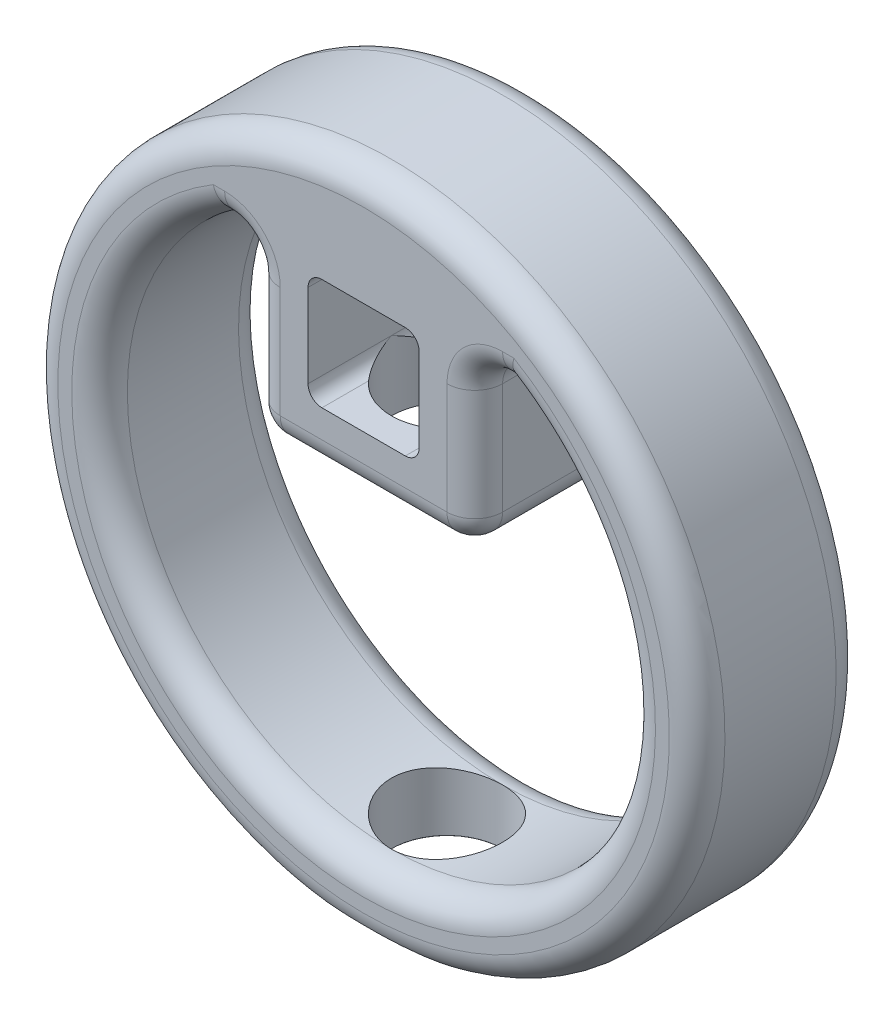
ISO-10303-21;
HEADER;
FILE_DESCRIPTION(('STEP AP214'),'2;1');
FILE_NAME('part.step','',(''),(''),'','','');
FILE_SCHEMA(('AUTOMOTIVE_DESIGN { 1 0 10303 214 1 1 1 1 }'));
ENDSEC;
DATA;
#1=APPLICATION_CONTEXT('core data for automotive mechanical design processes');
#2=APPLICATION_PROTOCOL_DEFINITION('international standard','automotive_design',2000,#1);
#3=PRODUCT_CONTEXT('',#1,'mechanical');
#4=PRODUCT('Part','Part','',(#3));
#5=PRODUCT_RELATED_PRODUCT_CATEGORY('part','',(#4));
#6=PRODUCT_DEFINITION_FORMATION('','',#4);
#7=PRODUCT_DEFINITION_CONTEXT('part definition',#1,'design');
#8=PRODUCT_DEFINITION('design','',#6,#7);
#9=PRODUCT_DEFINITION_SHAPE('','',#8);
#10=(LENGTH_UNIT() NAMED_UNIT(*) SI_UNIT(.MILLI.,.METRE.));
#11=(NAMED_UNIT(*) PLANE_ANGLE_UNIT() SI_UNIT($,.RADIAN.));
#12=(NAMED_UNIT(*) SI_UNIT($,.STERADIAN.) SOLID_ANGLE_UNIT());
#13=UNCERTAINTY_MEASURE_WITH_UNIT(LENGTH_MEASURE(1.E-05),#10,'distance_accuracy_value','');
#14=(GEOMETRIC_REPRESENTATION_CONTEXT(3) GLOBAL_UNCERTAINTY_ASSIGNED_CONTEXT((#13)) GLOBAL_UNIT_ASSIGNED_CONTEXT((#10,
#11,#12)) REPRESENTATION_CONTEXT('',''));
#15=CARTESIAN_POINT('',(0.,0.,0.));
#16=DIRECTION('',(0.,0.,1.));
#17=DIRECTION('',(1.,0.,0.));
#18=AXIS2_PLACEMENT_3D('',#15,#16,#17);
#19=CARTESIAN_POINT('',(-2.66385974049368,-4.73259262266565,12.));
#20=DIRECTION('',(0.,1.,0.));
#21=DIRECTION('',(-1.,0.,0.));
#22=AXIS2_PLACEMENT_3D('',#19,#20,#21);
#23=PLANE('',#22);
#24=CARTESIAN_POINT('',(0.33614025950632,-4.73259262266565,6.));
#25=DIRECTION('',(0.,1.,0.));
#26=DIRECTION('',(-1.,0.,0.));
#27=AXIS2_PLACEMENT_3D('',#24,#25,#26);
#28=CIRCLE('',#27,4.);
#29=CARTESIAN_POINT('',(-2.66385974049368,-4.73259262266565,8.64575131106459));
#30=VERTEX_POINT('',#29);
#31=CARTESIAN_POINT('',(3.33614025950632,-4.73259262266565,8.64575131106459));
#32=VERTEX_POINT('',#31);
#33=EDGE_CURVE('E480',#30,#32,#28,.T.);
#34=ORIENTED_EDGE('',*,*,#33,.F.);
#35=DIRECTION('',(0.,0.,-1.));
#36=VECTOR('',#35,1.);
#37=CARTESIAN_POINT('',(-2.66385974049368,-4.73259262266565,12.));
#38=LINE('',#37,#36);
#39=CARTESIAN_POINT('',(-2.66385974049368,-4.73259262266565,12.));
#40=VERTEX_POINT('',#39);
#41=EDGE_CURVE('E499',#40,#30,#38,.T.);
#42=ORIENTED_EDGE('',*,*,#41,.F.);
#43=DIRECTION('',(1.,0.,0.));
#44=VECTOR('',#43,1.);
#45=CARTESIAN_POINT('',(-2.66385974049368,-4.73259262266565,12.));
#46=LINE('',#45,#44);
#47=CARTESIAN_POINT('',(3.33614025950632,-4.73259262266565,12.));
#48=VERTEX_POINT('',#47);
#49=EDGE_CURVE('E680',#40,#48,#46,.T.);
#50=ORIENTED_EDGE('',*,*,#49,.T.);
#51=DIRECTION('',(0.,0.,-1.));
#52=VECTOR('',#51,1.);
#53=CARTESIAN_POINT('',(3.33614025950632,-4.73259262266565,12.));
#54=LINE('',#53,#52);
#55=EDGE_CURVE('E488',#48,#32,#54,.T.);
#56=ORIENTED_EDGE('',*,*,#55,.T.);
#57=EDGE_LOOP('',(#34,#42,#50,#56));
#58=FACE_BOUND('',#57,.T.);
#59=ADVANCED_FACE('F41',(#58),#23,.T.);
#60=CARTESIAN_POINT('',(-5.66385974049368,-8.73259262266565,12.));
#61=DIRECTION('',(0.,-1.,0.));
#62=DIRECTION('',(0.,0.,-1.));
#63=AXIS2_PLACEMENT_3D('',#60,#61,#62);
#64=PLANE('',#63);
#65=CARTESIAN_POINT('',(0.33614025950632,-8.73259262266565,6.));
#66=DIRECTION('',(0.,-1.,0.));
#67=DIRECTION('',(0.,0.,-1.));
#68=AXIS2_PLACEMENT_3D('',#65,#66,#67);
#69=CIRCLE('',#68,4.);
#70=CARTESIAN_POINT('',(0.33614025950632,-8.73259262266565,2.));
#71=VERTEX_POINT('',#70);
#72=CARTESIAN_POINT('',(0.33614025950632,-8.73259262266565,10.));
#73=VERTEX_POINT('',#72);
#74=EDGE_CURVE('E268',#71,#73,#69,.T.);
#75=ORIENTED_EDGE('',*,*,#74,.F.);
#76=DIRECTION('',(-1.,0.,0.));
#77=VECTOR('',#76,1.);
#78=CARTESIAN_POINT('',(6.33614025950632,-8.73259262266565,2.));
#79=LINE('',#78,#77);
#80=CARTESIAN_POINT('',(6.33614025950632,-8.73259262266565,2.));
#81=VERTEX_POINT('',#80);
#82=EDGE_CURVE('E279',#71,#81,#79,.F.);
#83=ORIENTED_EDGE('',*,*,#82,.T.);
#84=DIRECTION('',(0.,0.,-1.));
#85=VECTOR('',#84,1.);
#86=CARTESIAN_POINT('',(6.33614025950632,-8.73259262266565,12.));
#87=LINE('',#86,#85);
#88=CARTESIAN_POINT('',(6.33614025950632,-8.73259262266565,10.));
#89=VERTEX_POINT('',#88);
#90=EDGE_CURVE('E673',#89,#81,#87,.T.);
#91=ORIENTED_EDGE('',*,*,#90,.F.);
#92=DIRECTION('',(-1.,0.,0.));
#93=VECTOR('',#92,1.);
#94=CARTESIAN_POINT('',(-5.66385974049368,-8.73259262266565,10.));
#95=LINE('',#94,#93);
#96=EDGE_CURVE('E282',#89,#73,#95,.T.);
#97=ORIENTED_EDGE('',*,*,#96,.T.);
#98=EDGE_LOOP('',(#75,#83,#91,#97));
#99=FACE_BOUND('',#98,.T.);
#100=ADVANCED_FACE('F277',(#99),#64,.T.);
#101=CARTESIAN_POINT('',(0.336140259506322,-12.7325926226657,12.));
#102=DIRECTION('',(0.,0.,-1.));
#103=DIRECTION('',(-1.,0.,0.));
#104=AXIS2_PLACEMENT_3D('',#101,#102,#103);
#105=CYLINDRICAL_SURFACE('',#104,19.);
#106=CARTESIAN_POINT('',(0.33614025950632,-31.7325926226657,10.));
#107=CARTESIAN_POINT('',(0.558195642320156,-31.7325885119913,9.99999214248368));
#108=CARTESIAN_POINT('',(0.780347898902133,-31.7286601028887,9.98144682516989));
#109=CARTESIAN_POINT('',(1.2183560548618,-31.7133681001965,9.90782443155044));
#110=CARTESIAN_POINT('',(1.43420710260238,-31.7019989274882,9.85271994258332));
#111=CARTESIAN_POINT('',(1.85321816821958,-31.6730929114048,9.70777064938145));
#112=CARTESIAN_POINT('',(2.05639071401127,-31.6555622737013,9.61796079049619));
#113=CARTESIAN_POINT('',(2.44477365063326,-31.616231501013,9.40625792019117));
#114=CARTESIAN_POINT('',(2.62998477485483,-31.5944315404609,9.28436621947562));
#115=CARTESIAN_POINT('',(2.97996237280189,-31.5485914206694,9.01003263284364));
#116=CARTESIAN_POINT('',(3.14442222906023,-31.5245251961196,8.85720390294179));
#117=CARTESIAN_POINT('',(3.44557186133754,-31.4770512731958,8.52616549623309));
#118=CARTESIAN_POINT('',(3.58225930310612,-31.4536436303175,8.34795368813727));
#119=CARTESIAN_POINT('',(3.8253154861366,-31.4098813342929,7.96896837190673));
#120=CARTESIAN_POINT('',(3.93136180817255,-31.3895601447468,7.76798387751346));
#121=CARTESIAN_POINT('',(4.10805851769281,-31.3546440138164,7.35054960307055));
#122=CARTESIAN_POINT('',(4.17871280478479,-31.3400484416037,7.13410152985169));
#123=CARTESIAN_POINT('',(4.28161449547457,-31.3185008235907,6.69519837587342));
#124=CARTESIAN_POINT('',(4.3144026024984,-31.3114412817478,6.47287545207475));
#125=CARTESIAN_POINT('',(4.342321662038,-31.3054418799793,6.02578081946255));
#126=CARTESIAN_POINT('',(4.3374568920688,-31.3065010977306,5.80100939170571));
#127=CARTESIAN_POINT('',(4.29064432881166,-31.3165220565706,5.35938908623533));
#128=CARTESIAN_POINT('',(4.2493209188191,-31.3253507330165,5.14247054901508));
#129=CARTESIAN_POINT('',(4.13175167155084,-31.3497058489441,4.71871557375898));
#130=CARTESIAN_POINT('',(4.05550400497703,-31.3652326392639,4.5118796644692));
#131=CARTESIAN_POINT('',(3.8696671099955,-31.4013678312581,4.11238623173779));
#132=CARTESIAN_POINT('',(3.75983449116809,-31.4220131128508,3.91984540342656));
#133=CARTESIAN_POINT('',(3.51011683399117,-31.466035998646,3.55569441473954));
#134=CARTESIAN_POINT('',(3.37022798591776,-31.4894139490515,3.38408691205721));
#135=CARTESIAN_POINT('',(3.06104664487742,-31.5368414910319,3.0630754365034));
#136=CARTESIAN_POINT('',(2.89122232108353,-31.5608951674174,2.91418382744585));
#137=CARTESIAN_POINT('',(2.52874727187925,-31.6065373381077,2.64691498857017));
#138=CARTESIAN_POINT('',(2.33609618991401,-31.6281257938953,2.52853823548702));
#139=CARTESIAN_POINT('',(1.93283615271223,-31.666467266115,2.32554714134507));
#140=CARTESIAN_POINT('',(1.72219442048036,-31.6832112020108,2.24099609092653));
#141=CARTESIAN_POINT('',(1.28926370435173,-31.709908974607,2.10862822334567));
#142=CARTESIAN_POINT('',(1.0669762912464,-31.7198637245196,2.06080646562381));
#143=CARTESIAN_POINT('',(0.621462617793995,-31.7317327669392,2.0039909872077));
#144=CARTESIAN_POINT('',(0.398329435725,-31.7337920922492,1.99429680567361));
#145=CARTESIAN_POINT('',(-0.0463680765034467,-31.7300430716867,2.01211853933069));
#146=CARTESIAN_POINT('',(-0.267932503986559,-31.7242352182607,2.03963212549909));
#147=CARTESIAN_POINT('',(-0.700909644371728,-31.705495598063,2.13050700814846));
#148=CARTESIAN_POINT('',(-0.912402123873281,-31.6926361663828,2.19350448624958));
#149=CARTESIAN_POINT('',(-1.321820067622,-31.6612313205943,2.353157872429));
#150=CARTESIAN_POINT('',(-1.51974443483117,-31.6426854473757,2.44981649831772));
#151=CARTESIAN_POINT('',(-1.89933016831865,-31.6016054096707,2.67553282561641));
#152=CARTESIAN_POINT('',(-2.08073858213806,-31.5790212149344,2.80500661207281));
#153=CARTESIAN_POINT('',(-2.41950535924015,-31.5324784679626,3.09212597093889));
#154=CARTESIAN_POINT('',(-2.576860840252,-31.50851975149,3.24977491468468));
#155=CARTESIAN_POINT('',(-2.86579497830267,-31.4614326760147,3.59197271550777));
#156=CARTESIAN_POINT('',(-2.99689040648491,-31.4383253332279,3.77693299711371));
#157=CARTESIAN_POINT('',(-3.22615717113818,-31.3960243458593,4.16665843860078));
#158=CARTESIAN_POINT('',(-3.32432989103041,-31.3768305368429,4.37142276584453));
#159=CARTESIAN_POINT('',(-3.48432783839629,-31.3447040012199,4.79387009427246));
#160=CARTESIAN_POINT('',(-3.54635113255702,-31.331737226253,5.01147536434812));
#161=CARTESIAN_POINT('',(-3.63287969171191,-31.3134664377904,5.4543246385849));
#162=CARTESIAN_POINT('',(-3.65739045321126,-31.3081613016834,5.67956751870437));
#163=CARTESIAN_POINT('',(-3.66797777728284,-31.3058814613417,6.12643545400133));
#164=CARTESIAN_POINT('',(-3.65481929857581,-31.3087409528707,6.34804188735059));
#165=CARTESIAN_POINT('',(-3.59214199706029,-31.3220952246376,6.7858051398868));
#166=CARTESIAN_POINT('',(-3.54262353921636,-31.3325899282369,7.00196201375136));
#167=CARTESIAN_POINT('',(-3.40898900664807,-31.3599542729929,7.42213676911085));
#168=CARTESIAN_POINT('',(-3.32497642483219,-31.3768048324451,7.62618889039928));
#169=CARTESIAN_POINT('',(-3.12483041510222,-31.4149911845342,8.01741806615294));
#170=CARTESIAN_POINT('',(-3.00869392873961,-31.4363274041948,8.20459351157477));
#171=CARTESIAN_POINT('',(-2.74502574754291,-31.4815817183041,8.5605443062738));
#172=CARTESIAN_POINT('',(-2.596945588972,-31.505540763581,8.72890825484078));
#173=CARTESIAN_POINT('',(-2.274714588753,-31.5530577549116,9.03864942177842));
#174=CARTESIAN_POINT('',(-2.10055774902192,-31.5766156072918,9.18002041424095));
#175=CARTESIAN_POINT('',(-1.72863771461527,-31.62100552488,9.43335399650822));
#176=CARTESIAN_POINT('',(-1.53061970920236,-31.6418020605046,9.5449490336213));
#177=CARTESIAN_POINT('',(-1.11824881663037,-31.6779729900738,9.73309803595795));
#178=CARTESIAN_POINT('',(-0.903910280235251,-31.6933520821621,9.80968238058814));
#179=CARTESIAN_POINT('',(-0.518338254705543,-31.7141013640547,9.91145338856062));
#180=CARTESIAN_POINT('',(-0.349241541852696,-31.7209937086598,9.94459690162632));
#181=CARTESIAN_POINT('',(-0.00806912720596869,-31.730240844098,9.98887283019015));
#182=CARTESIAN_POINT('',(0.164006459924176,-31.732595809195,10.0000060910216));
#183=CARTESIAN_POINT('',(0.33614025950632,-31.7325926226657,10.));
#184=B_SPLINE_CURVE_WITH_KNOTS('',3,(#106,#107,#108,#109,#110,#111,#112,#113,#114,#115,#116,
#117,#118,#119,#120,#121,#122,#123,#124,#125,#126,#127,#128,#129,#130,#131,#132,#133,#134,#135,
#136,#137,#138,#139,#140,#141,#142,#143,#144,#145,#146,#147,#148,#149,#150,#151,#152,#153,#154,
#155,#156,#157,#158,#159,#160,#161,#162,#163,#164,#165,#166,#167,#168,#169,#170,#171,#172,#173,
#174,#175,#176,#177,#178,#179,#180,#181,#182,#183),.UNSPECIFIED.,.T.,.F.,(4,2,2,2,2,2,2,2,2,2,2,
2,2,2,2,2,2,2,2,2,2,2,2,2,2,2,2,2,2,2,2,2,2,2,2,2,2,2,4),(0.,0.665536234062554,1.33157206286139,
1.99693899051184,2.66227873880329,3.33651839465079,4.0108146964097,4.69196738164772,
5.37304499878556,6.04427211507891,6.7154229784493,7.37529822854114,8.03520804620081,
8.7000183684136,9.36491300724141,10.0430975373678,10.7212926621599,11.4007508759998,
12.080117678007,12.7469435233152,13.4137276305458,14.0737964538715,14.7339185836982,
15.4028707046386,16.0719029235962,16.7522989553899,17.4326663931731,18.1092701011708,
18.7857746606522,19.4486393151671,20.111497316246,20.772380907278,21.4333274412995,
22.1066821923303,22.7801920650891,23.4616668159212,24.1425491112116,24.658482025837,
25.1743951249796),.UNSPECIFIED.);
#185=CARTESIAN_POINT('',(0.33614025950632,-31.7325926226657,10.));
#186=VERTEX_POINT('',#185);
#187=CARTESIAN_POINT('',(0.33614025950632,-31.7325926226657,2.));
#188=VERTEX_POINT('',#187);
#189=EDGE_CURVE('E59',#186,#188,#184,.T.);
#190=ORIENTED_EDGE('',*,*,#189,.F.);
#191=CARTESIAN_POINT('',(0.336140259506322,-12.7325926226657,10.));
#192=DIRECTION('',(0.,0.,1.));
#193=DIRECTION('',(1.,0.,0.));
#194=AXIS2_PLACEMENT_3D('',#191,#192,#193);
#195=CIRCLE('',#194,19.);
#196=CARTESIAN_POINT('',(10.5830910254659,3.26740737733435,10.));
#197=VERTEX_POINT('',#196);
#198=EDGE_CURVE('E518',#186,#197,#195,.T.);
#199=ORIENTED_EDGE('',*,*,#198,.T.);
#200=DIRECTION('',(0.,0.,-1.));
#201=VECTOR('',#200,1.);
#202=CARTESIAN_POINT('',(10.5830910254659,3.26740737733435,12.));
#203=LINE('',#202,#201);
#204=CARTESIAN_POINT('',(10.5830910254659,3.26740737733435,2.));
#205=VERTEX_POINT('',#204);
#206=EDGE_CURVE('E651',#197,#205,#203,.T.);
#207=ORIENTED_EDGE('',*,*,#206,.T.);
#208=CARTESIAN_POINT('',(0.336140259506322,-12.7325926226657,2.));
#209=DIRECTION('',(0.,0.,1.));
#210=DIRECTION('',(1.,0.,0.));
#211=AXIS2_PLACEMENT_3D('',#208,#209,#210);
#212=CIRCLE('',#211,19.);
#213=EDGE_CURVE('E524',#205,#188,#212,.F.);
#214=ORIENTED_EDGE('',*,*,#213,.T.);
#215=EDGE_LOOP('',(#190,#199,#207,#214));
#216=FACE_BOUND('',#215,.T.);
#217=ADVANCED_FACE('F416',(#216),#105,.F.);
#218=CARTESIAN_POINT('',(-6.51951434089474,-35.7325926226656,12.));
#219=DIRECTION('',(0.,1.,0.));
#220=DIRECTION('',(0.,0.,1.));
#221=AXIS2_PLACEMENT_3D('',#218,#219,#220);
#222=PLANE('',#221);
#223=DIRECTION('',(0.,0.,-1.));
#224=VECTOR('',#223,1.);
#225=CARTESIAN_POINT('',(7.19179485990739,-35.7325926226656,12.));
#226=LINE('',#225,#224);
#227=CARTESIAN_POINT('',(7.19179485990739,-35.7325926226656,10.));
#228=VERTEX_POINT('',#227);
#229=CARTESIAN_POINT('',(7.19179485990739,-35.7325926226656,2.00000000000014));
#230=VERTEX_POINT('',#229);
#231=EDGE_CURVE('E503',#228,#230,#226,.T.);
#232=ORIENTED_EDGE('',*,*,#231,.F.);
#233=CARTESIAN_POINT('',(7.1917948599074,-35.7325926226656,10.));
#234=CARTESIAN_POINT('',(7.19191481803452,-35.7325926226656,10.0376590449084));
#235=CARTESIAN_POINT('',(7.18807761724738,-35.7325926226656,10.0751480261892));
#236=CARTESIAN_POINT('',(7.1736349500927,-35.7325926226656,10.1482792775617));
#237=CARTESIAN_POINT('',(7.16312493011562,-35.7325926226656,10.1839400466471));
#238=CARTESIAN_POINT('',(7.13344908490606,-35.7325926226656,10.2607211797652));
#239=CARTESIAN_POINT('',(7.11287538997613,-35.7325926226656,10.3012849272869));
#240=CARTESIAN_POINT('',(7.0654577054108,-35.7325926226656,10.3787425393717));
#241=CARTESIAN_POINT('',(7.03857865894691,-35.7325926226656,10.4156141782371));
#242=CARTESIAN_POINT('',(6.96087471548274,-35.7325926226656,10.5092721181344));
#243=CARTESIAN_POINT('',(6.90611283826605,-35.7325926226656,10.5627503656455));
#244=CARTESIAN_POINT('',(6.78971466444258,-35.7325926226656,10.6613843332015));
#245=CARTESIAN_POINT('',(6.728065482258,-35.7325926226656,10.7065240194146));
#246=CARTESIAN_POINT('',(6.57738789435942,-35.7325926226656,10.8055894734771));
#247=CARTESIAN_POINT('',(6.48655691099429,-35.7325926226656,10.8567391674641));
#248=CARTESIAN_POINT('',(6.30044593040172,-35.7325926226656,10.9503260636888));
#249=CARTESIAN_POINT('',(6.20515721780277,-35.7325926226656,10.9927452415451));
#250=CARTESIAN_POINT('',(6.01136993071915,-35.7325926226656,11.0710701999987));
#251=CARTESIAN_POINT('',(5.91285670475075,-35.7325926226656,11.1069392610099));
#252=CARTESIAN_POINT('',(5.7141665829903,-35.7325926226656,11.1732762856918));
#253=CARTESIAN_POINT('',(5.61399144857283,-35.7325926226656,11.203749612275));
#254=CARTESIAN_POINT('',(5.42189704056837,-35.7325926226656,11.2576885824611));
#255=CARTESIAN_POINT('',(5.33008582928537,-35.7325926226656,11.2815435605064));
#256=CARTESIAN_POINT('',(5.14572823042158,-35.7325926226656,11.3262356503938));
#257=CARTESIAN_POINT('',(5.05318176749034,-35.7325926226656,11.3470724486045));
#258=CARTESIAN_POINT('',(4.77464126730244,-35.7325926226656,11.4057472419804));
#259=CARTESIAN_POINT('',(4.58783335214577,-35.7325926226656,11.4397261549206));
#260=CARTESIAN_POINT('',(4.2125939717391,-35.7325926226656,11.4999701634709));
#261=CARTESIAN_POINT('',(4.02415980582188,-35.7325926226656,11.5262177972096));
#262=CARTESIAN_POINT('',(3.64652703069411,-35.7325926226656,11.5725781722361));
#263=CARTESIAN_POINT('',(3.45732833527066,-35.7325926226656,11.5926902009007));
#264=CARTESIAN_POINT('',(3.07840023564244,-35.7325926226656,11.6279795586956));
#265=CARTESIAN_POINT('',(2.8886706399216,-35.7325926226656,11.6431547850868));
#266=CARTESIAN_POINT('',(2.5089225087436,-35.7325926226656,11.6694188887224));
#267=CARTESIAN_POINT('',(2.3189039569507,-35.7325926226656,11.6805075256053));
#268=CARTESIAN_POINT('',(1.93896171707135,-35.7325926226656,11.6991969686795));
#269=CARTESIAN_POINT('',(1.7490382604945,-35.7325926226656,11.7068025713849));
#270=CARTESIAN_POINT('',(1.36909198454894,-35.7325926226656,11.7189625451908));
#271=CARTESIAN_POINT('',(1.1790691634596,-35.7325926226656,11.7235168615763));
#272=CARTESIAN_POINT('',(0.801736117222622,-35.7325926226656,11.7297749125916));
#273=CARTESIAN_POINT('',(0.61442654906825,-35.7325926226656,11.7315190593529));
#274=CARTESIAN_POINT('',(0.239801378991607,-35.7325926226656,11.7323747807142));
#275=CARTESIAN_POINT('',(0.0524857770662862,-35.7325926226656,11.731486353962));
#276=CARTESIAN_POINT('',(-0.322239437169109,-35.7325926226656,11.7270288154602));
#277=CARTESIAN_POINT('',(-0.509649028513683,-35.7325926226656,11.7234579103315));
#278=CARTESIAN_POINT('',(-0.884388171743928,-35.7325926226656,11.713445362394));
#279=CARTESIAN_POINT('',(-1.07171772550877,-35.7325926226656,11.7070037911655));
#280=CARTESIAN_POINT('',(-1.44682349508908,-35.7325926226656,11.6908847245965));
#281=CARTESIAN_POINT('',(-1.6345992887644,-35.7325926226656,11.681197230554));
#282=CARTESIAN_POINT('',(-2.00991574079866,-35.7325926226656,11.658072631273));
#283=CARTESIAN_POINT('',(-2.1974564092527,-35.7325926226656,11.6446356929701));
#284=CARTESIAN_POINT('',(-2.57200874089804,-35.7325926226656,11.6132905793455));
#285=CARTESIAN_POINT('',(-2.75902071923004,-35.7325926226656,11.5953862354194));
#286=CARTESIAN_POINT('',(-3.13242894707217,-35.7325926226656,11.5540890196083));
#287=CARTESIAN_POINT('',(-3.31882526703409,-35.7325926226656,11.530696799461));
#288=CARTESIAN_POINT('',(-3.69267925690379,-35.7325926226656,11.4767091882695));
#289=CARTESIAN_POINT('',(-3.88012605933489,-35.7325926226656,11.4460374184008));
#290=CARTESIAN_POINT('',(-4.25362140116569,-35.7325926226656,11.3754914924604));
#291=CARTESIAN_POINT('',(-4.4396676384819,-35.7325926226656,11.3356046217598));
#292=CARTESIAN_POINT('',(-4.71552819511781,-35.7325926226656,11.266638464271));
#293=CARTESIAN_POINT('',(-4.80651917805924,-35.7325926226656,11.2422651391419));
#294=CARTESIAN_POINT('',(-4.98743494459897,-35.7325926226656,11.1898613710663));
#295=CARTESIAN_POINT('',(-5.07735994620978,-35.7325926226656,11.1618316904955));
#296=CARTESIAN_POINT('',(-5.25551990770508,-35.7325926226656,11.1014197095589));
#297=CARTESIAN_POINT('',(-5.3437582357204,-35.7325926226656,11.0690474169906));
#298=CARTESIAN_POINT('',(-5.51802867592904,-35.7325926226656,10.9988744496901));
#299=CARTESIAN_POINT('',(-5.60406236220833,-35.7325926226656,10.9610777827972));
#300=CARTESIAN_POINT('',(-5.72124908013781,-35.7325926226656,10.9037397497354));
#301=CARTESIAN_POINT('',(-5.75384533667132,-35.7325926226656,10.8871383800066));
#302=CARTESIAN_POINT('',(-5.81841257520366,-35.7325926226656,10.8527572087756));
#303=CARTESIAN_POINT('',(-5.85038349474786,-35.7325926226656,10.8349772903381));
#304=CARTESIAN_POINT('',(-5.94533582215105,-35.7325926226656,10.7795746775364));
#305=CARTESIAN_POINT('',(-6.00719476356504,-35.7325926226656,10.7399665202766));
#306=CARTESIAN_POINT('',(-6.12685358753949,-35.7325926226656,10.6536786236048));
#307=CARTESIAN_POINT('',(-6.18460268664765,-35.7325926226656,10.6069274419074));
#308=CARTESIAN_POINT('',(-6.29203164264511,-35.7325926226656,10.5048570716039));
#309=CARTESIAN_POINT('',(-6.34174380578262,-35.7325926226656,10.4495740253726));
#310=CARTESIAN_POINT('',(-6.40607222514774,-35.7325926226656,10.3586112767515));
#311=CARTESIAN_POINT('',(-6.42592428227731,-35.7325926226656,10.3266633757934));
#312=CARTESIAN_POINT('',(-6.46074357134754,-35.7325926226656,10.2602988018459));
#313=CARTESIAN_POINT('',(-6.47572860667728,-35.7325926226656,10.2258917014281));
#314=CARTESIAN_POINT('',(-6.49961332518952,-35.7325926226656,10.1547628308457));
#315=CARTESIAN_POINT('',(-6.50848093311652,-35.7325926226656,10.1180299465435));
#316=CARTESIAN_POINT('',(-6.51918427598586,-35.7325926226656,10.0430575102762));
#317=CARTESIAN_POINT('',(-6.52092108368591,-35.7325926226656,10.0048041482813));
#318=CARTESIAN_POINT('',(-6.51854054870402,-35.7325926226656,9.96664563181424));
#319=B_SPLINE_CURVE_WITH_KNOTS('',3,(#233,#234,#235,#236,#237,#238,#239,#240,#241,#242,#243,
#244,#245,#246,#247,#248,#249,#250,#251,#252,#253,#254,#255,#256,#257,#258,#259,#260,#261,#262,
#263,#264,#265,#266,#267,#268,#269,#270,#271,#272,#273,#274,#275,#276,#277,#278,#279,#280,#281,
#282,#283,#284,#285,#286,#287,#288,#289,#290,#291,#292,#293,#294,#295,#296,#297,#298,#299,#300,
#301,#302,#303,#304,#305,#306,#307,#308,#309,#310,#311,#312,#313,#314,#315,#316,#317,#318),
.UNSPECIFIED.,.F.,.F.,(4,2,2,2,2,2,2,2,2,2,2,2,2,2,2,2,2,2,2,2,2,2,2,2,2,2,2,2,2,2,2,2,2,2,2,2,
2,2,2,2,2,2,4),(0.,0.112509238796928,0.223444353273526,0.359125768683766,0.495580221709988,
0.723916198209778,0.95268676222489,1.26466687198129,1.57728475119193,1.89160467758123,
2.2056104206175,2.49013035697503,2.77467983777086,3.3440493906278,3.91469523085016,
4.4854073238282,5.05636218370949,5.62735062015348,6.19755036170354,6.76776032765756,
7.32969464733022,7.89162925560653,8.45393988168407,9.01623648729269,9.5802813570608,
10.1443011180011,10.7078388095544,11.2713096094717,11.8409764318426,12.4114340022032,
12.6939722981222,12.9764517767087,13.2582911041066,13.5399232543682,13.6496426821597,
13.7593730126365,13.9793710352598,14.201734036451,14.4231796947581,14.535708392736,
14.6478207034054,14.7605164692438,14.8747705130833),.UNSPECIFIED.);
#320=CARTESIAN_POINT('',(-6.51951434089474,-35.7325926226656,9.99999999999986));
#321=VERTEX_POINT('',#320);
#322=EDGE_CURVE('E428',#228,#321,#319,.T.);
#323=ORIENTED_EDGE('',*,*,#322,.T.);
#324=DIRECTION('',(0.,0.,-1.));
#325=VECTOR('',#324,1.);
#326=CARTESIAN_POINT('',(-6.51951434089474,-35.7325926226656,12.));
#327=LINE('',#326,#325);
#328=CARTESIAN_POINT('',(-6.51951434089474,-35.7325926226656,2.));
#329=VERTEX_POINT('',#328);
#330=EDGE_CURVE('E507',#321,#329,#327,.T.);
#331=ORIENTED_EDGE('',*,*,#330,.T.);
#332=CARTESIAN_POINT('',(-6.51951434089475,-35.7325926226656,2.));
#333=CARTESIAN_POINT('',(-6.51963429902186,-35.7325926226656,1.96234095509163));
#334=CARTESIAN_POINT('',(-6.51579709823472,-35.7325926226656,1.92485197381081));
#335=CARTESIAN_POINT('',(-6.50135443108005,-35.7325926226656,1.85172072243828));
#336=CARTESIAN_POINT('',(-6.49084441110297,-35.7325926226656,1.81605995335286));
#337=CARTESIAN_POINT('',(-6.46116856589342,-35.7325926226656,1.73927882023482));
#338=CARTESIAN_POINT('',(-6.44059487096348,-35.7325926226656,1.69871507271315));
#339=CARTESIAN_POINT('',(-6.39317718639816,-35.7325926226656,1.62125746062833));
#340=CARTESIAN_POINT('',(-6.36629813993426,-35.7325926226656,1.58438582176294));
#341=CARTESIAN_POINT('',(-6.28859419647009,-35.7325926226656,1.49072788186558));
#342=CARTESIAN_POINT('',(-6.23383231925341,-35.7325926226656,1.43724963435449));
#343=CARTESIAN_POINT('',(-6.11743414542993,-35.7325926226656,1.33861566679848));
#344=CARTESIAN_POINT('',(-6.05578496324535,-35.7325926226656,1.29347598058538));
#345=CARTESIAN_POINT('',(-5.90510737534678,-35.7325926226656,1.19441052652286));
#346=CARTESIAN_POINT('',(-5.81427639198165,-35.7325926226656,1.14326083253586));
#347=CARTESIAN_POINT('',(-5.62816541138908,-35.7325926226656,1.04967393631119));
#348=CARTESIAN_POINT('',(-5.53287669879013,-35.7325926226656,1.00725475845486));
#349=CARTESIAN_POINT('',(-5.33908941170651,-35.7325926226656,0.928929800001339));
#350=CARTESIAN_POINT('',(-5.24057618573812,-35.7325926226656,0.893060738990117));
#351=CARTESIAN_POINT('',(-5.04188606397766,-35.7325926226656,0.826723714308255));
#352=CARTESIAN_POINT('',(-4.94171092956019,-35.7325926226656,0.79625038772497));
#353=CARTESIAN_POINT('',(-4.74961652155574,-35.7325926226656,0.742311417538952));
#354=CARTESIAN_POINT('',(-4.65780531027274,-35.7325926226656,0.718456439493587));
#355=CARTESIAN_POINT('',(-4.47344771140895,-35.7325926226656,0.673764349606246));
#356=CARTESIAN_POINT('',(-4.38090124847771,-35.7325926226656,0.652927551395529));
#357=CARTESIAN_POINT('',(-4.10236074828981,-35.7325926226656,0.594252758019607));
#358=CARTESIAN_POINT('',(-3.91555283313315,-35.7325926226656,0.560273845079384));
#359=CARTESIAN_POINT('',(-3.54031345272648,-35.7325926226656,0.500029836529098));
#360=CARTESIAN_POINT('',(-3.35187928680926,-35.7325926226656,0.473782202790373));
#361=CARTESIAN_POINT('',(-2.97424651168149,-35.7325926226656,0.427421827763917));
#362=CARTESIAN_POINT('',(-2.78504781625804,-35.7325926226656,0.407309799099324));
#363=CARTESIAN_POINT('',(-2.40611971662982,-35.7325926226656,0.372020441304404));
#364=CARTESIAN_POINT('',(-2.21639012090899,-35.7325926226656,0.356845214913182));
#365=CARTESIAN_POINT('',(-1.83664198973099,-35.7325926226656,0.3305811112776));
#366=CARTESIAN_POINT('',(-1.64662343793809,-35.7325926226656,0.319492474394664));
#367=CARTESIAN_POINT('',(-1.26668119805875,-35.7325926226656,0.300803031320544));
#368=CARTESIAN_POINT('',(-1.0767577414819,-35.7325926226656,0.293197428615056));
#369=CARTESIAN_POINT('',(-0.696811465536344,-35.7325926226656,0.281037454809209));
#370=CARTESIAN_POINT('',(-0.506788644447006,-35.7325926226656,0.276483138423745));
#371=CARTESIAN_POINT('',(-0.129455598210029,-35.7325926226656,0.270225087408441));
#372=CARTESIAN_POINT('',(0.0578539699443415,-35.7325926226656,0.268480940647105));
#373=CARTESIAN_POINT('',(0.432479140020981,-35.7325926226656,0.26762521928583));
#374=CARTESIAN_POINT('',(0.619794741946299,-35.7325926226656,0.268513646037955));
#375=CARTESIAN_POINT('',(0.99451995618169,-35.7325926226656,0.2729711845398));
#376=CARTESIAN_POINT('',(1.18192954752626,-35.7325926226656,0.276542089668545));
#377=CARTESIAN_POINT('',(1.5566686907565,-35.7325926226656,0.28655463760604));
#378=CARTESIAN_POINT('',(1.74399824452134,-35.7325926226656,0.292996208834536));
#379=CARTESIAN_POINT('',(2.11910401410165,-35.7325926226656,0.309115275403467));
#380=CARTESIAN_POINT('',(2.30687980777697,-35.7325926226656,0.318802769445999));
#381=CARTESIAN_POINT('',(2.68219625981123,-35.7325926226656,0.341927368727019));
#382=CARTESIAN_POINT('',(2.86973692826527,-35.7325926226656,0.355364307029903));
#383=CARTESIAN_POINT('',(3.2442892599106,-35.7325926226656,0.386709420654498));
#384=CARTESIAN_POINT('',(3.4313012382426,-35.7325926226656,0.404613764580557));
#385=CARTESIAN_POINT('',(3.80470946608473,-35.7325926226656,0.44591098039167));
#386=CARTESIAN_POINT('',(3.99110578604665,-35.7325926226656,0.469303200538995));
#387=CARTESIAN_POINT('',(4.36495977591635,-35.7325926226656,0.5232908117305));
#388=CARTESIAN_POINT('',(4.55240657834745,-35.7325926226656,0.553962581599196));
#389=CARTESIAN_POINT('',(4.92590192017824,-35.7325926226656,0.624508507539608));
#390=CARTESIAN_POINT('',(5.11194815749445,-35.7325926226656,0.664395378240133));
#391=CARTESIAN_POINT('',(5.38780871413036,-35.7325926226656,0.73336153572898));
#392=CARTESIAN_POINT('',(5.47879969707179,-35.7325926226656,0.757734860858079));
#393=CARTESIAN_POINT('',(5.65971546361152,-35.7325926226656,0.81013862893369));
#394=CARTESIAN_POINT('',(5.74964046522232,-35.7325926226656,0.838168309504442));
#395=CARTESIAN_POINT('',(5.92780042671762,-35.7325926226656,0.898580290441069));
#396=CARTESIAN_POINT('',(6.01603875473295,-35.7325926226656,0.93095258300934));
#397=CARTESIAN_POINT('',(6.19030919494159,-35.7325926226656,1.00112555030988));
#398=CARTESIAN_POINT('',(6.27634288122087,-35.7325926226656,1.03892221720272));
#399=CARTESIAN_POINT('',(6.39352959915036,-35.7325926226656,1.09626025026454));
#400=CARTESIAN_POINT('',(6.42612585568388,-35.7325926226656,1.11286161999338));
#401=CARTESIAN_POINT('',(6.49069309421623,-35.7325926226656,1.14724279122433));
#402=CARTESIAN_POINT('',(6.52266401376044,-35.7325926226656,1.16502270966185));
#403=CARTESIAN_POINT('',(6.61761634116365,-35.7325926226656,1.22042532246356));
#404=CARTESIAN_POINT('',(6.67947528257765,-35.7325926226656,1.26003347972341));
#405=CARTESIAN_POINT('',(6.79913410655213,-35.7325926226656,1.34632137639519));
#406=CARTESIAN_POINT('',(6.85688320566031,-35.7325926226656,1.39307255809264));
#407=CARTESIAN_POINT('',(6.96431216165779,-35.7325926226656,1.49514292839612));
#408=CARTESIAN_POINT('',(7.01402432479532,-35.7325926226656,1.55042597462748));
#409=CARTESIAN_POINT('',(7.07835274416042,-35.7325926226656,1.64138872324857));
#410=CARTESIAN_POINT('',(7.09820480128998,-35.7325926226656,1.67333662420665));
#411=CARTESIAN_POINT('',(7.1330240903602,-35.7325926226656,1.73970119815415));
#412=CARTESIAN_POINT('',(7.14800912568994,-35.7325926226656,1.77410829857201));
#413=CARTESIAN_POINT('',(7.17189384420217,-35.7325926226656,1.84523716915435));
#414=CARTESIAN_POINT('',(7.18076145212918,-35.7325926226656,1.88197005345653));
#415=CARTESIAN_POINT('',(7.19146479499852,-35.7325926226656,1.95694248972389));
#416=CARTESIAN_POINT('',(7.19320160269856,-35.7325926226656,1.99519585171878));
#417=CARTESIAN_POINT('',(7.19082106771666,-35.7325926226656,2.03335436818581));
#418=B_SPLINE_CURVE_WITH_KNOTS('',3,(#332,#333,#334,#335,#336,#337,#338,#339,#340,#341,#342,
#343,#344,#345,#346,#347,#348,#349,#350,#351,#352,#353,#354,#355,#356,#357,#358,#359,#360,#361,
#362,#363,#364,#365,#366,#367,#368,#369,#370,#371,#372,#373,#374,#375,#376,#377,#378,#379,#380,
#381,#382,#383,#384,#385,#386,#387,#388,#389,#390,#391,#392,#393,#394,#395,#396,#397,#398,#399,
#400,#401,#402,#403,#404,#405,#406,#407,#408,#409,#410,#411,#412,#413,#414,#415,#416,#417),
.UNSPECIFIED.,.F.,.F.,(4,2,2,2,2,2,2,2,2,2,2,2,2,2,2,2,2,2,2,2,2,2,2,2,2,2,2,2,2,2,2,2,2,2,2,2,
2,2,2,2,2,2,4),(0.,0.112509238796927,0.223444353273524,0.359125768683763,0.495580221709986,
0.723916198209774,0.952686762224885,1.26466687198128,1.57728475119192,1.89160467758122,
2.20561042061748,2.49013035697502,2.77467983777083,3.34404939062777,3.91469523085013,
4.48540732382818,5.05636218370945,5.62735062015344,6.19755036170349,6.76776032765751,
7.32969464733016,7.89162925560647,8.453939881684,9.01623648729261,9.58028135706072,
10.144301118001,10.7078388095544,11.2713096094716,11.8409764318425,12.4114340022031,
12.6939722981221,12.9764517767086,13.2582911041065,13.5399232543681,13.6496426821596,
13.7593730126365,13.9793710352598,14.2017340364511,14.4231796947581,14.5357083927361,
14.6478207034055,14.7605164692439,14.8747705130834),.UNSPECIFIED.);
#419=EDGE_CURVE('E421',#329,#230,#418,.T.);
#420=ORIENTED_EDGE('',*,*,#419,.T.);
#421=EDGE_LOOP('',(#232,#323,#331,#420));
#422=FACE_BOUND('',#421,.T.);
#423=CARTESIAN_POINT('',(0.33614025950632,-35.7325926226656,6.));
#424=DIRECTION('',(0.,-1.,0.));
#425=DIRECTION('',(0.,0.,-1.));
#426=AXIS2_PLACEMENT_3D('',#423,#424,#425);
#427=CIRCLE('',#426,4.025);
#428=CARTESIAN_POINT('',(0.33614025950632,-35.7325926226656,1.975));
#429=VERTEX_POINT('',#428);
#430=EDGE_CURVE('E550',#429,#429,#427,.T.);
#431=ORIENTED_EDGE('',*,*,#430,.F.);
#432=EDGE_LOOP('',(#431));
#433=FACE_BOUND('',#432,.T.);
#434=ADVANCED_FACE('F411',(#422,#433),#222,.F.);
#435=CARTESIAN_POINT('',(-2.66385974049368,-3.73259262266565,12.));
#436=DIRECTION('',(0.,0.,-1.));
#437=DIRECTION('',(-1.,0.,0.));
#438=AXIS2_PLACEMENT_3D('',#435,#436,#437);
#439=CYLINDRICAL_SURFACE('',#438,1.);
#440=CARTESIAN_POINT('',(-2.66385974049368,-4.73259262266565,3.35424868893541));
#441=CARTESIAN_POINT('',(-2.70694103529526,-4.73257036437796,3.40308356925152));
#442=CARTESIAN_POINT('',(-2.74877199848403,-4.72981130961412,3.45293371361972));
#443=CARTESIAN_POINT('',(-2.82966757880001,-4.71959655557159,3.55422156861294));
#444=CARTESIAN_POINT('',(-2.86873734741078,-4.71214987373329,3.60565605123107));
#445=CARTESIAN_POINT('',(-2.94370682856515,-4.69340701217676,3.70943778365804));
#446=CARTESIAN_POINT('',(-2.97962964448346,-4.6821424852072,3.76177427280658));
#447=CARTESIAN_POINT('',(-3.04862391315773,-4.65634252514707,3.86754579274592));
#448=CARTESIAN_POINT('',(-3.08169347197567,-4.64180494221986,3.92098152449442));
#449=CARTESIAN_POINT('',(-3.16255664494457,-4.60112092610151,4.0587186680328));
#450=CARTESIAN_POINT('',(-3.20830449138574,-4.57301599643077,4.14365037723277));
#451=CARTESIAN_POINT('',(-3.29292203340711,-4.51170042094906,4.31505089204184));
#452=CARTESIAN_POINT('',(-3.33178930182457,-4.47848798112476,4.40152022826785));
#453=CARTESIAN_POINT('',(-3.43869320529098,-4.3726971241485,4.66347183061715));
#454=CARTESIAN_POINT('',(-3.49661429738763,-4.294198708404,4.84077455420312));
#455=CARTESIAN_POINT('',(-3.58236910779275,-4.13699024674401,5.17977239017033));
#456=CARTESIAN_POINT('',(-3.6126254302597,-4.05908041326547,5.34126263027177));
#457=CARTESIAN_POINT('',(-3.65310657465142,-3.90017725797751,5.66477681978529));
#458=CARTESIAN_POINT('',(-3.66338601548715,-3.81919296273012,5.82679809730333));
#459=CARTESIAN_POINT('',(-3.66385440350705,-3.73636382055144,5.99245759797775));
#460=CARTESIAN_POINT('',(-3.66385973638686,-3.73447819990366,5.99622883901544));
#461=CARTESIAN_POINT('',(-3.66385974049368,-3.73259262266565,6.));
#462=B_SPLINE_CURVE_WITH_KNOTS('',3,(#440,#441,#442,#443,#444,#445,#446,#447,#448,#449,#450,
#451,#452,#453,#454,#455,#456,#457,#458,#459,#460,#461),.UNSPECIFIED.,.F.,.F.,(4,2,2,2,2,2,2,2,
2,2,4),(0.,0.195194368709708,0.390014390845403,0.583257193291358,0.776627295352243,
1.07759313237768,1.37866492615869,1.98338003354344,2.52784959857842,3.07082842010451,
3.08347754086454),.UNSPECIFIED.);
#463=CARTESIAN_POINT('',(-2.66385974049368,-4.73259262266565,3.35424868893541));
#464=VERTEX_POINT('',#463);
#465=CARTESIAN_POINT('',(-3.66385974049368,-3.73259262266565,6.));
#466=VERTEX_POINT('',#465);
#467=EDGE_CURVE('E631',#464,#466,#462,.T.);
#468=ORIENTED_EDGE('',*,*,#467,.F.);
#469=CARTESIAN_POINT('',(-2.66385974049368,-4.73259262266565,0.));
#470=VERTEX_POINT('',#469);
#471=EDGE_CURVE('E477',#464,#470,#38,.T.);
#472=ORIENTED_EDGE('',*,*,#471,.T.);
#473=CARTESIAN_POINT('',(-2.66385974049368,-3.73259262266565,0.));
#474=DIRECTION('',(0.,0.,1.));
#475=DIRECTION('',(1.,0.,0.));
#476=AXIS2_PLACEMENT_3D('',#473,#474,#475);
#477=CIRCLE('',#476,1.);
#478=CARTESIAN_POINT('',(-3.66385974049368,-3.73259262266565,0.));
#479=VERTEX_POINT('',#478);
#480=EDGE_CURVE('E676',#479,#470,#477,.T.);
#481=ORIENTED_EDGE('',*,*,#480,.F.);
#482=DIRECTION('',(0.,0.,-1.));
#483=VECTOR('',#482,1.);
#484=CARTESIAN_POINT('',(-3.66385974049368,-3.73259262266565,12.));
#485=LINE('',#484,#483);
#486=EDGE_CURVE('E703',#466,#479,#485,.T.);
#487=ORIENTED_EDGE('',*,*,#486,.F.);
#488=EDGE_LOOP('',(#468,#472,#481,#487));
#489=FACE_BOUND('',#488,.T.);
#490=ADVANCED_FACE('F415',(#489),#439,.F.);
#491=CARTESIAN_POINT('',(3.33614025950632,-3.73259262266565,12.));
#492=DIRECTION('',(0.,0.,-1.));
#493=DIRECTION('',(-1.,0.,0.));
#494=AXIS2_PLACEMENT_3D('',#491,#492,#493);
#495=CYLINDRICAL_SURFACE('',#494,1.);
#496=CARTESIAN_POINT('',(3.33614025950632,-4.73259262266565,8.64575131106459));
#497=CARTESIAN_POINT('',(3.37922155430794,-4.73257036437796,8.59691643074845));
#498=CARTESIAN_POINT('',(3.42105251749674,-4.72981130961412,8.54706628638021));
#499=CARTESIAN_POINT('',(3.50194809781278,-4.71959655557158,8.4457784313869));
#500=CARTESIAN_POINT('',(3.54101786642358,-4.71214987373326,8.39434394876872));
#501=CARTESIAN_POINT('',(3.61598734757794,-4.69340701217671,8.29056221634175));
#502=CARTESIAN_POINT('',(3.65191016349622,-4.68214248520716,8.23822572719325));
#503=CARTESIAN_POINT('',(3.72090443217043,-4.65634252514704,8.13245420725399));
#504=CARTESIAN_POINT('',(3.75397399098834,-4.64180494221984,8.07901847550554));
#505=CARTESIAN_POINT('',(3.83483716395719,-4.60112092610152,7.94128133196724));
#506=CARTESIAN_POINT('',(3.88058501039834,-4.57301599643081,7.85634962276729));
#507=CARTESIAN_POINT('',(3.96520255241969,-4.5117004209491,7.6849491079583));
#508=CARTESIAN_POINT('',(4.00406982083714,-4.47848798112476,7.59847977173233));
#509=CARTESIAN_POINT('',(4.11097372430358,-4.37269712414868,7.33652816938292));
#510=CARTESIAN_POINT('',(4.16889481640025,-4.29419870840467,7.15922544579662));
#511=CARTESIAN_POINT('',(4.2546496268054,-4.13699024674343,6.82022760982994));
#512=CARTESIAN_POINT('',(4.28490594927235,-4.05908041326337,6.65873736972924));
#513=CARTESIAN_POINT('',(4.32538709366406,-3.9001772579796,6.33522318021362));
#514=CARTESIAN_POINT('',(4.33566653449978,-3.81919296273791,6.17320190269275));
#515=CARTESIAN_POINT('',(4.33613492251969,-3.73636382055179,6.00754240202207));
#516=CARTESIAN_POINT('',(4.3361402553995,-3.73447819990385,6.00377116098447));
#517=CARTESIAN_POINT('',(4.33614025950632,-3.73259262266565,6.));
#518=B_SPLINE_CURVE_WITH_KNOTS('',3,(#496,#497,#498,#499,#500,#501,#502,#503,#504,#505,#506,
#507,#508,#509,#510,#511,#512,#513,#514,#515,#516,#517),.UNSPECIFIED.,.F.,.F.,(4,2,2,2,2,2,2,2,
2,2,4),(0.,0.19519436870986,0.390014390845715,0.583257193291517,0.776627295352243,
1.07759313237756,1.37866492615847,1.98338003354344,2.52784959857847,3.07082842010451,
3.08347754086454),.UNSPECIFIED.);
#519=CARTESIAN_POINT('',(4.33614025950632,-3.73259262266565,6.));
#520=VERTEX_POINT('',#519);
#521=EDGE_CURVE('E67',#32,#520,#518,.T.);
#522=ORIENTED_EDGE('',*,*,#521,.F.);
#523=ORIENTED_EDGE('',*,*,#55,.F.);
#524=CARTESIAN_POINT('',(3.33614025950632,-3.73259262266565,12.));
#525=DIRECTION('',(0.,0.,1.));
#526=DIRECTION('',(1.,0.,0.));
#527=AXIS2_PLACEMENT_3D('',#524,#525,#526);
#528=CIRCLE('',#527,1.);
#529=CARTESIAN_POINT('',(4.33614025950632,-3.73259262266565,12.));
#530=VERTEX_POINT('',#529);
#531=EDGE_CURVE('E684',#48,#530,#528,.T.);
#532=ORIENTED_EDGE('',*,*,#531,.T.);
#533=DIRECTION('',(0.,0.,-1.));
#534=VECTOR('',#533,1.);
#535=CARTESIAN_POINT('',(4.33614025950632,-3.73259262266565,12.));
#536=LINE('',#535,#534);
#537=EDGE_CURVE('E489',#530,#520,#536,.T.);
#538=ORIENTED_EDGE('',*,*,#537,.T.);
#539=EDGE_LOOP('',(#522,#523,#532,#538));
#540=FACE_BOUND('',#539,.T.);
#541=ADVANCED_FACE('F468',(#540),#495,.F.);
#542=CARTESIAN_POINT('',(0.336140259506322,-12.7325926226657,12.));
#543=DIRECTION('',(0.,0.,1.));
#544=DIRECTION('',(1.,0.,0.));
#545=AXIS2_PLACEMENT_3D('',#542,#543,#544);
#546=PLANE('',#545);
#547=CARTESIAN_POINT('',(0.336140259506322,-12.7325926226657,12.));
#548=DIRECTION('',(0.,0.,1.));
#549=DIRECTION('',(1.,0.,0.));
#550=AXIS2_PLACEMENT_3D('',#547,#548,#549);
#551=CIRCLE('',#550,22.);
#552=CARTESIAN_POINT('',(6.62049030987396,-33.815925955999,12.));
#553=VERTEX_POINT('',#552);
#554=EDGE_CURVE('E528',#553,#553,#551,.T.);
#555=ORIENTED_EDGE('',*,*,#554,.T.);
#556=EDGE_LOOP('',(#555));
#557=FACE_BOUND('',#556,.T.);
#558=ORIENTED_EDGE('',*,*,#49,.F.);
#559=CARTESIAN_POINT('',(-2.66385974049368,-3.73259262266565,12.));
#560=DIRECTION('',(0.,0.,1.));
#561=DIRECTION('',(1.,0.,0.));
#562=AXIS2_PLACEMENT_3D('',#559,#560,#561);
#563=CIRCLE('',#562,1.);
#564=CARTESIAN_POINT('',(-3.66385974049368,-3.73259262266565,12.));
#565=VERTEX_POINT('',#564);
#566=EDGE_CURVE('E677',#565,#40,#563,.T.);
#567=ORIENTED_EDGE('',*,*,#566,.F.);
#568=DIRECTION('',(0.,-1.,0.));
#569=VECTOR('',#568,1.);
#570=CARTESIAN_POINT('',(-3.66385974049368,2.26740737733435,12.));
#571=LINE('',#570,#569);
#572=CARTESIAN_POINT('',(-3.66385974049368,2.26740737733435,12.));
#573=VERTEX_POINT('',#572);
#574=EDGE_CURVE('E700',#573,#565,#571,.T.);
#575=ORIENTED_EDGE('',*,*,#574,.F.);
#576=CARTESIAN_POINT('',(-2.66385974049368,2.26740737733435,12.));
#577=DIRECTION('',(0.,0.,1.));
#578=DIRECTION('',(1.,0.,0.));
#579=AXIS2_PLACEMENT_3D('',#576,#577,#578);
#580=CIRCLE('',#579,1.);
#581=CARTESIAN_POINT('',(-2.66385974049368,3.26740737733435,12.));
#582=VERTEX_POINT('',#581);
#583=EDGE_CURVE('E696',#582,#573,#580,.T.);
#584=ORIENTED_EDGE('',*,*,#583,.F.);
#585=DIRECTION('',(-1.,0.,0.));
#586=VECTOR('',#585,1.);
#587=CARTESIAN_POINT('',(-2.66385974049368,3.26740737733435,12.));
#588=LINE('',#587,#586);
#589=CARTESIAN_POINT('',(3.33614025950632,3.26740737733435,12.));
#590=VERTEX_POINT('',#589);
#591=EDGE_CURVE('E693',#590,#582,#588,.T.);
#592=ORIENTED_EDGE('',*,*,#591,.F.);
#593=CARTESIAN_POINT('',(3.33614025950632,2.26740737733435,12.));
#594=DIRECTION('',(0.,0.,1.));
#595=DIRECTION('',(-1.,0.,0.));
#596=AXIS2_PLACEMENT_3D('',#593,#594,#595);
#597=CIRCLE('',#596,1.);
#598=CARTESIAN_POINT('',(4.33614025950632,2.26740737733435,12.));
#599=VERTEX_POINT('',#598);
#600=EDGE_CURVE('E690',#599,#590,#597,.T.);
#601=ORIENTED_EDGE('',*,*,#600,.F.);
#602=DIRECTION('',(0.,1.,0.));
#603=VECTOR('',#602,1.);
#604=CARTESIAN_POINT('',(4.33614025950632,2.26740737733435,12.));
#605=LINE('',#604,#603);
#606=EDGE_CURVE('E687',#530,#599,#605,.T.);
#607=ORIENTED_EDGE('',*,*,#606,.F.);
#608=ORIENTED_EDGE('',*,*,#531,.F.);
#609=EDGE_LOOP('',(#558,#567,#575,#584,#592,#601,#607,#608));
#610=FACE_BOUND('',#609,.T.);
#611=DIRECTION('',(-1.,0.,0.));
#612=VECTOR('',#611,1.);
#613=CARTESIAN_POINT('',(0.336140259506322,5.26740737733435,12.));
#614=LINE('',#613,#612);
#615=CARTESIAN_POINT('',(10.3361402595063,5.26740737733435,12.));
#616=VERTEX_POINT('',#615);
#617=CARTESIAN_POINT('',(11.1527940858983,5.26740737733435,12.));
#618=VERTEX_POINT('',#617);
#619=EDGE_CURVE('E938',#616,#618,#614,.F.);
#620=ORIENTED_EDGE('',*,*,#619,.T.);
#621=CARTESIAN_POINT('',(0.336140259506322,-12.7325926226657,12.));
#622=DIRECTION('',(0.,0.,1.));
#623=DIRECTION('',(1.,0.,0.));
#624=AXIS2_PLACEMENT_3D('',#621,#622,#623);
#625=CIRCLE('',#624,21.);
#626=CARTESIAN_POINT('',(-10.4805135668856,5.26740737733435,12.));
#627=VERTEX_POINT('',#626);
#628=EDGE_CURVE('E532',#618,#627,#625,.F.);
#629=ORIENTED_EDGE('',*,*,#628,.T.);
#630=DIRECTION('',(-1.,0.,0.));
#631=VECTOR('',#630,1.);
#632=CARTESIAN_POINT('',(0.336140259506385,5.26740737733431,12.));
#633=LINE('',#632,#631);
#634=CARTESIAN_POINT('',(-9.66385974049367,5.26740737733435,12.));
#635=VERTEX_POINT('',#634);
#636=EDGE_CURVE('E905',#627,#635,#633,.F.);
#637=ORIENTED_EDGE('',*,*,#636,.T.);
#638=CARTESIAN_POINT('',(-9.66385974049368,1.26740737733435,12.));
#639=DIRECTION('',(0.,0.,1.));
#640=DIRECTION('',(1.,0.,0.));
#641=AXIS2_PLACEMENT_3D('',#638,#639,#640);
#642=CIRCLE('',#641,4.);
#643=CARTESIAN_POINT('',(-5.66385974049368,1.26740737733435,12.));
#644=VERTEX_POINT('',#643);
#645=EDGE_CURVE('E902',#635,#644,#642,.F.);
#646=ORIENTED_EDGE('',*,*,#645,.T.);
#647=DIRECTION('',(0.,1.,0.));
#648=VECTOR('',#647,1.);
#649=CARTESIAN_POINT('',(-5.66385974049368,-12.7325926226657,12.));
#650=LINE('',#649,#648);
#651=CARTESIAN_POINT('',(-5.66385974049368,-6.73259262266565,12.));
#652=VERTEX_POINT('',#651);
#653=EDGE_CURVE('E950',#644,#652,#650,.F.);
#654=ORIENTED_EDGE('',*,*,#653,.T.);
#655=DIRECTION('',(-1.,0.,0.));
#656=VECTOR('',#655,1.);
#657=CARTESIAN_POINT('',(0.336140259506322,-6.73259262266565,12.));
#658=LINE('',#657,#656);
#659=CARTESIAN_POINT('',(6.33614025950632,-6.73259262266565,12.));
#660=VERTEX_POINT('',#659);
#661=EDGE_CURVE('E947',#652,#660,#658,.F.);
#662=ORIENTED_EDGE('',*,*,#661,.T.);
#663=DIRECTION('',(0.,-1.,0.));
#664=VECTOR('',#663,1.);
#665=CARTESIAN_POINT('',(6.33614025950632,-12.7325926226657,12.));
#666=LINE('',#665,#664);
#667=CARTESIAN_POINT('',(6.33614025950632,1.26740737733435,12.));
#668=VERTEX_POINT('',#667);
#669=EDGE_CURVE('E959',#660,#668,#666,.F.);
#670=ORIENTED_EDGE('',*,*,#669,.T.);
#671=CARTESIAN_POINT('',(10.3361402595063,1.26740737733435,12.));
#672=DIRECTION('',(0.,0.,1.));
#673=DIRECTION('',(1.,0.,0.));
#674=AXIS2_PLACEMENT_3D('',#671,#672,#673);
#675=CIRCLE('',#674,4.);
#676=EDGE_CURVE('E939',#668,#616,#675,.F.);
#677=ORIENTED_EDGE('',*,*,#676,.T.);
#678=EDGE_LOOP('',(#620,#629,#637,#646,#654,#662,#670,#677));
#679=FACE_BOUND('',#678,.T.);
#680=ADVANCED_FACE('F924',(#557,#610,#679),#546,.T.);
#681=CARTESIAN_POINT('',(0.336140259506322,-12.7325926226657,0.));
#682=DIRECTION('',(0.,0.,1.));
#683=DIRECTION('',(1.,0.,0.));
#684=AXIS2_PLACEMENT_3D('',#681,#682,#683);
#685=PLANE('',#684);
#686=CARTESIAN_POINT('',(0.336140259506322,-12.7325926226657,0.));
#687=DIRECTION('',(0.,0.,1.));
#688=DIRECTION('',(1.,0.,0.));
#689=AXIS2_PLACEMENT_3D('',#686,#687,#688);
#690=CIRCLE('',#689,21.);
#691=CARTESIAN_POINT('',(-10.4805135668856,5.26740737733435,0.));
#692=VERTEX_POINT('',#691);
#693=CARTESIAN_POINT('',(11.1527940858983,5.26740737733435,0.));
#694=VERTEX_POINT('',#693);
#695=EDGE_CURVE('E515',#692,#694,#690,.T.);
#696=ORIENTED_EDGE('',*,*,#695,.T.);
#697=DIRECTION('',(-1.,0.,0.));
#698=VECTOR('',#697,1.);
#699=CARTESIAN_POINT('',(10.3361402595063,5.26740737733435,0.));
#700=LINE('',#699,#698);
#701=CARTESIAN_POINT('',(10.3361402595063,5.26740737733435,0.));
#702=VERTEX_POINT('',#701);
#703=EDGE_CURVE('E296',#694,#702,#700,.T.);
#704=ORIENTED_EDGE('',*,*,#703,.T.);
#705=CARTESIAN_POINT('',(10.3361402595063,1.26740737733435,0.));
#706=DIRECTION('',(0.,0.,1.));
#707=DIRECTION('',(1.,0.,0.));
#708=AXIS2_PLACEMENT_3D('',#705,#706,#707);
#709=CIRCLE('',#708,4.);
#710=CARTESIAN_POINT('',(6.33614025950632,1.26740737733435,0.));
#711=VERTEX_POINT('',#710);
#712=EDGE_CURVE('E818',#702,#711,#709,.T.);
#713=ORIENTED_EDGE('',*,*,#712,.T.);
#714=DIRECTION('',(0.,-1.,0.));
#715=VECTOR('',#714,1.);
#716=CARTESIAN_POINT('',(6.33614025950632,-6.73259262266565,0.));
#717=LINE('',#716,#715);
#718=CARTESIAN_POINT('',(6.33614025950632,-6.73259262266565,0.));
#719=VERTEX_POINT('',#718);
#720=EDGE_CURVE('E807',#711,#719,#717,.T.);
#721=ORIENTED_EDGE('',*,*,#720,.T.);
#722=DIRECTION('',(-1.,0.,0.));
#723=VECTOR('',#722,1.);
#724=CARTESIAN_POINT('',(-5.66385974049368,-6.73259262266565,0.));
#725=LINE('',#724,#723);
#726=CARTESIAN_POINT('',(-5.66385974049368,-6.73259262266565,0.));
#727=VERTEX_POINT('',#726);
#728=EDGE_CURVE('E804',#719,#727,#725,.T.);
#729=ORIENTED_EDGE('',*,*,#728,.T.);
#730=DIRECTION('',(0.,1.,0.));
#731=VECTOR('',#730,1.);
#732=CARTESIAN_POINT('',(-5.66385974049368,1.26740737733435,0.));
#733=LINE('',#732,#731);
#734=CARTESIAN_POINT('',(-5.66385974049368,1.26740737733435,0.));
#735=VERTEX_POINT('',#734);
#736=EDGE_CURVE('E810',#727,#735,#733,.T.);
#737=ORIENTED_EDGE('',*,*,#736,.T.);
#738=CARTESIAN_POINT('',(-9.66385974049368,1.26740737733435,0.));
#739=DIRECTION('',(0.,0.,1.));
#740=DIRECTION('',(1.,0.,0.));
#741=AXIS2_PLACEMENT_3D('',#738,#739,#740);
#742=CIRCLE('',#741,4.);
#743=CARTESIAN_POINT('',(-9.66385974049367,5.26740737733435,0.));
#744=VERTEX_POINT('',#743);
#745=EDGE_CURVE('E813',#735,#744,#742,.T.);
#746=ORIENTED_EDGE('',*,*,#745,.T.);
#747=DIRECTION('',(-1.,0.,0.));
#748=VECTOR('',#747,1.);
#749=CARTESIAN_POINT('',(-13.2653302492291,5.26740737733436,0.));
#750=LINE('',#749,#748);
#751=EDGE_CURVE('E816',#744,#692,#750,.T.);
#752=ORIENTED_EDGE('',*,*,#751,.T.);
#753=EDGE_LOOP('',(#696,#704,#713,#721,#729,#737,#746,#752));
#754=FACE_BOUND('',#753,.T.);
#755=CARTESIAN_POINT('',(0.336140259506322,-12.7325926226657,0.));
#756=DIRECTION('',(0.,0.,1.));
#757=DIRECTION('',(1.,0.,0.));
#758=AXIS2_PLACEMENT_3D('',#755,#756,#757);
#759=CIRCLE('',#758,22.);
#760=CARTESIAN_POINT('',(6.62049030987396,-33.815925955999,0.));
#761=VERTEX_POINT('',#760);
#762=EDGE_CURVE('E511',#761,#761,#759,.F.);
#763=ORIENTED_EDGE('',*,*,#762,.T.);
#764=EDGE_LOOP('',(#763));
#765=FACE_BOUND('',#764,.T.);
#766=ORIENTED_EDGE('',*,*,#480,.T.);
#767=DIRECTION('',(1.,0.,0.));
#768=VECTOR('',#767,1.);
#769=CARTESIAN_POINT('',(-2.66385974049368,-4.73259262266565,0.));
#770=LINE('',#769,#768);
#771=CARTESIAN_POINT('',(3.33614025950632,-4.73259262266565,0.));
#772=VERTEX_POINT('',#771);
#773=EDGE_CURVE('E707',#470,#772,#770,.T.);
#774=ORIENTED_EDGE('',*,*,#773,.T.);
#775=CARTESIAN_POINT('',(3.33614025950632,-3.73259262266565,0.));
#776=DIRECTION('',(0.,0.,1.));
#777=DIRECTION('',(1.,0.,0.));
#778=AXIS2_PLACEMENT_3D('',#775,#776,#777);
#779=CIRCLE('',#778,1.);
#780=CARTESIAN_POINT('',(4.33614025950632,-3.73259262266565,0.));
#781=VERTEX_POINT('',#780);
#782=EDGE_CURVE('E485',#772,#781,#779,.T.);
#783=ORIENTED_EDGE('',*,*,#782,.T.);
#784=DIRECTION('',(0.,1.,0.));
#785=VECTOR('',#784,1.);
#786=CARTESIAN_POINT('',(4.33614025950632,2.26740737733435,0.));
#787=LINE('',#786,#785);
#788=CARTESIAN_POINT('',(4.33614025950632,2.26740737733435,0.));
#789=VERTEX_POINT('',#788);
#790=EDGE_CURVE('E712',#781,#789,#787,.T.);
#791=ORIENTED_EDGE('',*,*,#790,.T.);
#792=CARTESIAN_POINT('',(3.33614025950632,2.26740737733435,0.));
#793=DIRECTION('',(0.,0.,1.));
#794=DIRECTION('',(-1.,0.,0.));
#795=AXIS2_PLACEMENT_3D('',#792,#793,#794);
#796=CIRCLE('',#795,1.);
#797=CARTESIAN_POINT('',(3.33614025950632,3.26740737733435,0.));
#798=VERTEX_POINT('',#797);
#799=EDGE_CURVE('E716',#789,#798,#796,.T.);
#800=ORIENTED_EDGE('',*,*,#799,.T.);
#801=DIRECTION('',(-1.,0.,0.));
#802=VECTOR('',#801,1.);
#803=CARTESIAN_POINT('',(-2.66385974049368,3.26740737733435,0.));
#804=LINE('',#803,#802);
#805=CARTESIAN_POINT('',(-2.66385974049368,3.26740737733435,0.));
#806=VERTEX_POINT('',#805);
#807=EDGE_CURVE('E720',#798,#806,#804,.T.);
#808=ORIENTED_EDGE('',*,*,#807,.T.);
#809=CARTESIAN_POINT('',(-2.66385974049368,2.26740737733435,0.));
#810=DIRECTION('',(0.,0.,1.));
#811=DIRECTION('',(1.,0.,0.));
#812=AXIS2_PLACEMENT_3D('',#809,#810,#811);
#813=CIRCLE('',#812,1.);
#814=CARTESIAN_POINT('',(-3.66385974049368,2.26740737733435,0.));
#815=VERTEX_POINT('',#814);
#816=EDGE_CURVE('E724',#806,#815,#813,.T.);
#817=ORIENTED_EDGE('',*,*,#816,.T.);
#818=DIRECTION('',(0.,-1.,0.));
#819=VECTOR('',#818,1.);
#820=CARTESIAN_POINT('',(-3.66385974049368,2.26740737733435,0.));
#821=LINE('',#820,#819);
#822=EDGE_CURVE('E681',#815,#479,#821,.T.);
#823=ORIENTED_EDGE('',*,*,#822,.T.);
#824=EDGE_LOOP('',(#766,#774,#783,#791,#800,#808,#817,#823));
#825=FACE_BOUND('',#824,.T.);
#826=ADVANCED_FACE('F409',(#754,#765,#825),#685,.F.);
#827=CARTESIAN_POINT('',(0.336140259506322,-12.7325926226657,12.));
#828=DIRECTION('',(0.,0.,-1.));
#829=DIRECTION('',(-1.,0.,0.));
#830=AXIS2_PLACEMENT_3D('',#827,#828,#829);
#831=CYLINDRICAL_SURFACE('',#830,24.);
#832=ORIENTED_EDGE('',*,*,#330,.F.);
#833=CARTESIAN_POINT('',(0.336140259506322,-12.7325926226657,10.));
#834=DIRECTION('',(0.,0.,1.));
#835=DIRECTION('',(1.,0.,0.));
#836=AXIS2_PLACEMENT_3D('',#833,#834,#835);
#837=CIRCLE('',#836,24.);
#838=EDGE_CURVE('E538',#321,#228,#837,.F.);
#839=ORIENTED_EDGE('',*,*,#838,.T.);
#840=ORIENTED_EDGE('',*,*,#231,.T.);
#841=CARTESIAN_POINT('',(0.336140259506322,-12.7325926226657,2.));
#842=DIRECTION('',(0.,0.,1.));
#843=DIRECTION('',(1.,0.,0.));
#844=AXIS2_PLACEMENT_3D('',#841,#842,#843);
#845=CIRCLE('',#844,24.);
#846=EDGE_CURVE('E535',#230,#329,#845,.T.);
#847=ORIENTED_EDGE('',*,*,#846,.T.);
#848=EDGE_LOOP('',(#832,#839,#840,#847));
#849=FACE_BOUND('',#848,.T.);
#850=ADVANCED_FACE('F404',(#849),#831,.T.);
#851=CARTESIAN_POINT('',(-2.66385974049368,-4.73259262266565,8.64575131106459));
#852=CARTESIAN_POINT('',(-2.70694103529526,-4.73257036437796,8.59691643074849));
#853=CARTESIAN_POINT('',(-2.74877199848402,-4.72981130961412,8.5470662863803));
#854=CARTESIAN_POINT('',(-2.82966757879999,-4.7195965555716,8.4457784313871));
#855=CARTESIAN_POINT('',(-2.86873734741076,-4.7121498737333,8.39434394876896));
#856=CARTESIAN_POINT('',(-2.94370682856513,-4.69340701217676,8.290562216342));
#857=CARTESIAN_POINT('',(-2.97962964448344,-4.68214248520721,8.23822572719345));
#858=CARTESIAN_POINT('',(-3.04862391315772,-4.65634252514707,8.1324542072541));
#859=CARTESIAN_POINT('',(-3.08169347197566,-4.64180494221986,8.07901847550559));
#860=CARTESIAN_POINT('',(-3.16255664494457,-4.60112092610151,7.94128133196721));
#861=CARTESIAN_POINT('',(-3.20830449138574,-4.57301599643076,7.85634962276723));
#862=CARTESIAN_POINT('',(-3.29292203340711,-4.51170042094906,7.68494910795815));
#863=CARTESIAN_POINT('',(-3.33178930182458,-4.47848798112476,7.59847977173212));
#864=CARTESIAN_POINT('',(-3.43869320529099,-4.37269712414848,7.33652816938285));
#865=CARTESIAN_POINT('',(-3.49661429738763,-4.29419870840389,7.15922544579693));
#866=CARTESIAN_POINT('',(-3.58236910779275,-4.13699024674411,6.82022760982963));
#867=CARTESIAN_POINT('',(-3.61262543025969,-4.05908041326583,6.65873736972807));
#868=CARTESIAN_POINT('',(-3.65310657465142,-3.90017725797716,6.33522318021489));
#869=CARTESIAN_POINT('',(-3.66338601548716,-3.81919296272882,6.17320190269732));
#870=CARTESIAN_POINT('',(-3.66385440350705,-3.73636382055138,6.00754240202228));
#871=CARTESIAN_POINT('',(-3.66385973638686,-3.73447819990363,6.00377116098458));
#872=CARTESIAN_POINT('',(-3.66385974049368,-3.73259262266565,6.));
#873=B_SPLINE_CURVE_WITH_KNOTS('',3,(#851,#852,#853,#854,#855,#856,#857,#858,#859,#860,#861,
#862,#863,#864,#865,#866,#867,#868,#869,#870,#871,#872),.UNSPECIFIED.,.F.,.F.,(4,2,2,2,2,2,2,2,
2,2,4),(0.,0.195194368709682,0.39001439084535,0.583257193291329,0.776627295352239,
1.07759313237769,1.37866492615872,1.98338003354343,2.52784959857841,3.07082842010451,
3.08347754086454),.UNSPECIFIED.);
#874=EDGE_CURVE('E916',#466,#30,#873,.F.);
#875=ORIENTED_EDGE('',*,*,#874,.F.);
#876=EDGE_CURVE('E731',#565,#466,#485,.T.);
#877=ORIENTED_EDGE('',*,*,#876,.F.);
#878=ORIENTED_EDGE('',*,*,#566,.T.);
#879=ORIENTED_EDGE('',*,*,#41,.T.);
#880=EDGE_LOOP('',(#875,#877,#878,#879));
#881=FACE_BOUND('',#880,.T.);
#882=ADVANCED_FACE('F408',(#881),#439,.F.);
#883=CARTESIAN_POINT('',(3.33614025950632,-4.73259262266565,3.35424868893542));
#884=VERTEX_POINT('',#883);
#885=EDGE_CURVE('E472',#884,#464,#28,.T.);
#886=ORIENTED_EDGE('',*,*,#885,.F.);
#887=EDGE_CURVE('E475',#884,#772,#54,.T.);
#888=ORIENTED_EDGE('',*,*,#887,.T.);
#889=ORIENTED_EDGE('',*,*,#773,.F.);
#890=ORIENTED_EDGE('',*,*,#471,.F.);
#891=EDGE_LOOP('',(#886,#888,#889,#890));
#892=FACE_BOUND('',#891,.T.);
#893=ADVANCED_FACE('F451',(#892),#23,.T.);
#894=CARTESIAN_POINT('',(3.33614025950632,-4.73259262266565,3.35424868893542));
#895=CARTESIAN_POINT('',(3.37922155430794,-4.73257036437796,3.40308356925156));
#896=CARTESIAN_POINT('',(3.42105251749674,-4.72981130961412,3.4529337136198));
#897=CARTESIAN_POINT('',(3.50194809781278,-4.71959655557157,3.55422156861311));
#898=CARTESIAN_POINT('',(3.54101786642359,-4.71214987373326,3.60565605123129));
#899=CARTESIAN_POINT('',(3.61598734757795,-4.69340701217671,3.70943778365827));
#900=CARTESIAN_POINT('',(3.65191016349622,-4.68214248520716,3.76177427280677));
#901=CARTESIAN_POINT('',(3.72090443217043,-4.65634252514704,3.86754579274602));
#902=CARTESIAN_POINT('',(3.75397399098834,-4.64180494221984,3.92098152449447));
#903=CARTESIAN_POINT('',(3.83483716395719,-4.60112092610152,4.05871866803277));
#904=CARTESIAN_POINT('',(3.88058501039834,-4.57301599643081,4.14365037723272));
#905=CARTESIAN_POINT('',(3.96520255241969,-4.5117004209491,4.3150508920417));
#906=CARTESIAN_POINT('',(4.00406982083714,-4.47848798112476,4.40152022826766));
#907=CARTESIAN_POINT('',(4.11097372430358,-4.37269712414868,4.66347183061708));
#908=CARTESIAN_POINT('',(4.16889481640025,-4.29419870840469,4.8407745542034));
#909=CARTESIAN_POINT('',(4.2546496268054,-4.1369902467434,5.17977239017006));
#910=CARTESIAN_POINT('',(4.28490594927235,-4.05908041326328,5.34126263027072));
#911=CARTESIAN_POINT('',(4.32538709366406,-3.90017725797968,5.66477681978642));
#912=CARTESIAN_POINT('',(4.33566653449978,-3.81919296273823,5.82679809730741));
#913=CARTESIAN_POINT('',(4.33613492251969,-3.73636382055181,5.99245759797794));
#914=CARTESIAN_POINT('',(4.3361402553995,-3.73447819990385,5.99622883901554));
#915=CARTESIAN_POINT('',(4.33614025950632,-3.73259262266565,6.));
#916=B_SPLINE_CURVE_WITH_KNOTS('',3,(#894,#895,#896,#897,#898,#899,#900,#901,#902,#903,#904,
#905,#906,#907,#908,#909,#910,#911,#912,#913,#914,#915),.UNSPECIFIED.,.F.,.F.,(4,2,2,2,2,2,2,2,
2,2,4),(0.,0.195194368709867,0.390014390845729,0.583257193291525,0.776627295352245,
1.07759313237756,1.37866492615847,1.98338003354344,2.52784959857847,3.07082842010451,
3.08347754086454),.UNSPECIFIED.);
#917=EDGE_CURVE('E482',#520,#884,#916,.F.);
#918=ORIENTED_EDGE('',*,*,#917,.F.);
#919=EDGE_CURVE('E495',#520,#781,#536,.T.);
#920=ORIENTED_EDGE('',*,*,#919,.T.);
#921=ORIENTED_EDGE('',*,*,#782,.F.);
#922=ORIENTED_EDGE('',*,*,#887,.F.);
#923=EDGE_LOOP('',(#918,#920,#921,#922));
#924=FACE_BOUND('',#923,.T.);
#925=ADVANCED_FACE('F460',(#924),#495,.F.);
#926=CARTESIAN_POINT('',(4.33614025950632,2.26740737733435,12.));
#927=DIRECTION('',(-1.,0.,0.));
#928=DIRECTION('',(0.,0.,1.));
#929=AXIS2_PLACEMENT_3D('',#926,#927,#928);
#930=PLANE('',#929);
#931=ORIENTED_EDGE('',*,*,#919,.F.);
#932=ORIENTED_EDGE('',*,*,#537,.F.);
#933=ORIENTED_EDGE('',*,*,#606,.T.);
#934=DIRECTION('',(0.,0.,-1.));
#935=VECTOR('',#934,1.);
#936=CARTESIAN_POINT('',(4.33614025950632,2.26740737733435,12.));
#937=LINE('',#936,#935);
#938=EDGE_CURVE('E743',#599,#789,#937,.T.);
#939=ORIENTED_EDGE('',*,*,#938,.T.);
#940=ORIENTED_EDGE('',*,*,#790,.F.);
#941=EDGE_LOOP('',(#931,#932,#933,#939,#940));
#942=FACE_BOUND('',#941,.T.);
#943=ADVANCED_FACE('F466',(#942),#930,.T.);
#944=CARTESIAN_POINT('',(3.33614025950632,2.26740737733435,12.));
#945=DIRECTION('',(0.,0.,-1.));
#946=DIRECTION('',(-1.,0.,0.));
#947=AXIS2_PLACEMENT_3D('',#944,#945,#946);
#948=CYLINDRICAL_SURFACE('',#947,1.);
#949=ORIENTED_EDGE('',*,*,#799,.F.);
#950=ORIENTED_EDGE('',*,*,#938,.F.);
#951=ORIENTED_EDGE('',*,*,#600,.T.);
#952=DIRECTION('',(0.,0.,-1.));
#953=VECTOR('',#952,1.);
#954=CARTESIAN_POINT('',(3.33614025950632,3.26740737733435,12.));
#955=LINE('',#954,#953);
#956=EDGE_CURVE('E741',#590,#798,#955,.T.);
#957=ORIENTED_EDGE('',*,*,#956,.T.);
#958=EDGE_LOOP('',(#949,#950,#951,#957));
#959=FACE_BOUND('',#958,.T.);
#960=ADVANCED_FACE('F579',(#959),#948,.F.);
#961=CARTESIAN_POINT('',(-2.66385974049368,3.26740737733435,12.));
#962=DIRECTION('',(0.,-1.,0.));
#963=DIRECTION('',(1.,0.,0.));
#964=AXIS2_PLACEMENT_3D('',#961,#962,#963);
#965=PLANE('',#964);
#966=ORIENTED_EDGE('',*,*,#807,.F.);
#967=ORIENTED_EDGE('',*,*,#956,.F.);
#968=ORIENTED_EDGE('',*,*,#591,.T.);
#969=DIRECTION('',(0.,0.,-1.));
#970=VECTOR('',#969,1.);
#971=CARTESIAN_POINT('',(-2.66385974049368,3.26740737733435,12.));
#972=LINE('',#971,#970);
#973=EDGE_CURVE('E738',#582,#806,#972,.T.);
#974=ORIENTED_EDGE('',*,*,#973,.T.);
#975=EDGE_LOOP('',(#966,#967,#968,#974));
#976=FACE_BOUND('',#975,.T.);
#977=ADVANCED_FACE('F583',(#976),#965,.T.);
#978=CARTESIAN_POINT('',(-2.66385974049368,2.26740737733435,12.));
#979=DIRECTION('',(0.,0.,-1.));
#980=DIRECTION('',(-1.,0.,0.));
#981=AXIS2_PLACEMENT_3D('',#978,#979,#980);
#982=CYLINDRICAL_SURFACE('',#981,1.);
#983=ORIENTED_EDGE('',*,*,#816,.F.);
#984=ORIENTED_EDGE('',*,*,#973,.F.);
#985=ORIENTED_EDGE('',*,*,#583,.T.);
#986=DIRECTION('',(0.,0.,-1.));
#987=VECTOR('',#986,1.);
#988=CARTESIAN_POINT('',(-3.66385974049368,2.26740737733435,12.));
#989=LINE('',#988,#987);
#990=EDGE_CURVE('E735',#573,#815,#989,.T.);
#991=ORIENTED_EDGE('',*,*,#990,.T.);
#992=EDGE_LOOP('',(#983,#984,#985,#991));
#993=FACE_BOUND('',#992,.T.);
#994=ADVANCED_FACE('F587',(#993),#982,.F.);
#995=CARTESIAN_POINT('',(-3.66385974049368,2.26740737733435,12.));
#996=DIRECTION('',(1.,0.,0.));
#997=DIRECTION('',(0.,1.,0.));
#998=AXIS2_PLACEMENT_3D('',#995,#996,#997);
#999=PLANE('',#998);
#1000=ORIENTED_EDGE('',*,*,#876,.T.);
#1001=ORIENTED_EDGE('',*,*,#486,.T.);
#1002=ORIENTED_EDGE('',*,*,#822,.F.);
#1003=ORIENTED_EDGE('',*,*,#990,.F.);
#1004=ORIENTED_EDGE('',*,*,#574,.T.);
#1005=EDGE_LOOP('',(#1000,#1001,#1002,#1003,#1004));
#1006=FACE_BOUND('',#1005,.T.);
#1007=ADVANCED_FACE('F591',(#1006),#999,.T.);
#1008=CARTESIAN_POINT('',(6.33614025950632,-6.73259262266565,12.));
#1009=DIRECTION('',(0.,0.,-1.));
#1010=DIRECTION('',(-1.,0.,0.));
#1011=AXIS2_PLACEMENT_3D('',#1008,#1009,#1010);
#1012=CYLINDRICAL_SURFACE('',#1011,2.);
#1013=DIRECTION('',(0.,0.,-1.));
#1014=VECTOR('',#1013,1.);
#1015=CARTESIAN_POINT('',(8.33614025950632,-6.73259262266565,12.));
#1016=LINE('',#1015,#1014);
#1017=CARTESIAN_POINT('',(8.33614025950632,-6.73259262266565,10.));
#1018=VERTEX_POINT('',#1017);
#1019=CARTESIAN_POINT('',(8.33614025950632,-6.73259262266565,2.));
#1020=VERTEX_POINT('',#1019);
#1021=EDGE_CURVE('E638',#1018,#1020,#1016,.T.);
#1022=ORIENTED_EDGE('',*,*,#1021,.F.);
#1023=CARTESIAN_POINT('',(6.33614025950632,-6.73259262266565,10.));
#1024=DIRECTION('',(0.,0.,-1.));
#1025=DIRECTION('',(-1.,0.,0.));
#1026=AXIS2_PLACEMENT_3D('',#1023,#1024,#1025);
#1027=CIRCLE('',#1026,2.);
#1028=EDGE_CURVE('E777',#1018,#89,#1027,.T.);
#1029=ORIENTED_EDGE('',*,*,#1028,.T.);
#1030=ORIENTED_EDGE('',*,*,#90,.T.);
#1031=CARTESIAN_POINT('',(6.33614025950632,-6.73259262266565,2.));
#1032=DIRECTION('',(0.,0.,-1.));
#1033=DIRECTION('',(-1.,0.,0.));
#1034=AXIS2_PLACEMENT_3D('',#1031,#1032,#1033);
#1035=CIRCLE('',#1034,2.);
#1036=EDGE_CURVE('E783',#81,#1020,#1035,.F.);
#1037=ORIENTED_EDGE('',*,*,#1036,.T.);
#1038=EDGE_LOOP('',(#1022,#1029,#1030,#1037));
#1039=FACE_BOUND('',#1038,.T.);
#1040=ADVANCED_FACE('F595',(#1039),#1012,.T.);
#1041=EDGE_CURVE('E265',#73,#71,#69,.T.);
#1042=ORIENTED_EDGE('',*,*,#1041,.F.);
#1043=CARTESIAN_POINT('',(-5.66385974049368,-8.73259262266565,10.));
#1044=VERTEX_POINT('',#1043);
#1045=EDGE_CURVE('E304',#73,#1044,#95,.T.);
#1046=ORIENTED_EDGE('',*,*,#1045,.T.);
#1047=DIRECTION('',(0.,0.,-1.));
#1048=VECTOR('',#1047,1.);
#1049=CARTESIAN_POINT('',(-5.66385974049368,-8.73259262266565,12.));
#1050=LINE('',#1049,#1048);
#1051=CARTESIAN_POINT('',(-5.66385974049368,-8.73259262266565,2.));
#1052=VERTEX_POINT('',#1051);
#1053=EDGE_CURVE('E301',#1044,#1052,#1050,.T.);
#1054=ORIENTED_EDGE('',*,*,#1053,.T.);
#1055=EDGE_CURVE('E290',#1052,#71,#79,.F.);
#1056=ORIENTED_EDGE('',*,*,#1055,.T.);
#1057=EDGE_LOOP('',(#1042,#1046,#1054,#1056));
#1058=FACE_BOUND('',#1057,.T.);
#1059=ADVANCED_FACE('F299',(#1058),#64,.T.);
#1060=CARTESIAN_POINT('',(-5.66385974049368,-6.73259262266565,12.));
#1061=DIRECTION('',(0.,0.,-1.));
#1062=DIRECTION('',(-1.,0.,0.));
#1063=AXIS2_PLACEMENT_3D('',#1060,#1061,#1062);
#1064=CYLINDRICAL_SURFACE('',#1063,2.);
#1065=ORIENTED_EDGE('',*,*,#1053,.F.);
#1066=CARTESIAN_POINT('',(-5.66385974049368,-6.73259262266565,10.));
#1067=DIRECTION('',(0.,0.,-1.));
#1068=DIRECTION('',(-1.,0.,0.));
#1069=AXIS2_PLACEMENT_3D('',#1066,#1067,#1068);
#1070=CIRCLE('',#1069,2.);
#1071=CARTESIAN_POINT('',(-7.66385974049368,-6.73259262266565,10.));
#1072=VERTEX_POINT('',#1071);
#1073=EDGE_CURVE('E801',#1044,#1072,#1070,.T.);
#1074=ORIENTED_EDGE('',*,*,#1073,.T.);
#1075=DIRECTION('',(0.,0.,-1.));
#1076=VECTOR('',#1075,1.);
#1077=CARTESIAN_POINT('',(-7.66385974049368,-6.73259262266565,12.));
#1078=LINE('',#1077,#1076);
#1079=CARTESIAN_POINT('',(-7.66385974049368,-6.73259262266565,2.));
#1080=VERTEX_POINT('',#1079);
#1081=EDGE_CURVE('E667',#1072,#1080,#1078,.T.);
#1082=ORIENTED_EDGE('',*,*,#1081,.T.);
#1083=CARTESIAN_POINT('',(-5.66385974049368,-6.73259262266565,2.));
#1084=DIRECTION('',(0.,0.,-1.));
#1085=DIRECTION('',(-1.,0.,0.));
#1086=AXIS2_PLACEMENT_3D('',#1083,#1084,#1085);
#1087=CIRCLE('',#1086,2.);
#1088=EDGE_CURVE('E798',#1080,#1052,#1087,.F.);
#1089=ORIENTED_EDGE('',*,*,#1088,.T.);
#1090=EDGE_LOOP('',(#1065,#1074,#1082,#1089));
#1091=FACE_BOUND('',#1090,.T.);
#1092=ADVANCED_FACE('F601',(#1091),#1064,.T.);
#1093=CARTESIAN_POINT('',(-7.66385974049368,1.26740737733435,12.));
#1094=DIRECTION('',(-1.,0.,0.));
#1095=DIRECTION('',(0.,-1.,0.));
#1096=AXIS2_PLACEMENT_3D('',#1093,#1094,#1095);
#1097=PLANE('',#1096);
#1098=ORIENTED_EDGE('',*,*,#1081,.F.);
#1099=DIRECTION('',(0.,1.,0.));
#1100=VECTOR('',#1099,1.);
#1101=CARTESIAN_POINT('',(-7.66385974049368,1.26740737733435,10.));
#1102=LINE('',#1101,#1100);
#1103=CARTESIAN_POINT('',(-7.66385974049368,1.26740737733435,10.));
#1104=VERTEX_POINT('',#1103);
#1105=EDGE_CURVE('E795',#1072,#1104,#1102,.T.);
#1106=ORIENTED_EDGE('',*,*,#1105,.T.);
#1107=DIRECTION('',(0.,0.,-1.));
#1108=VECTOR('',#1107,1.);
#1109=CARTESIAN_POINT('',(-7.66385974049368,1.26740737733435,12.));
#1110=LINE('',#1109,#1108);
#1111=CARTESIAN_POINT('',(-7.66385974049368,1.26740737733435,2.));
#1112=VERTEX_POINT('',#1111);
#1113=EDGE_CURVE('E663',#1104,#1112,#1110,.T.);
#1114=ORIENTED_EDGE('',*,*,#1113,.T.);
#1115=DIRECTION('',(0.,1.,0.));
#1116=VECTOR('',#1115,1.);
#1117=CARTESIAN_POINT('',(-7.66385974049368,-6.73259262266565,2.));
#1118=LINE('',#1117,#1116);
#1119=EDGE_CURVE('E792',#1112,#1080,#1118,.F.);
#1120=ORIENTED_EDGE('',*,*,#1119,.T.);
#1121=EDGE_LOOP('',(#1098,#1106,#1114,#1120));
#1122=FACE_BOUND('',#1121,.T.);
#1123=ADVANCED_FACE('F604',(#1122),#1097,.T.);
#1124=CARTESIAN_POINT('',(-9.66385974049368,1.26740737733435,12.));
#1125=DIRECTION('',(0.,0.,-1.));
#1126=DIRECTION('',(-1.,0.,0.));
#1127=AXIS2_PLACEMENT_3D('',#1124,#1125,#1126);
#1128=CYLINDRICAL_SURFACE('',#1127,2.);
#1129=ORIENTED_EDGE('',*,*,#1113,.F.);
#1130=CARTESIAN_POINT('',(-9.66385974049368,1.26740737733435,10.));
#1131=DIRECTION('',(0.,0.,1.));
#1132=DIRECTION('',(1.,0.,0.));
#1133=AXIS2_PLACEMENT_3D('',#1130,#1131,#1132);
#1134=CIRCLE('',#1133,2.);
#1135=CARTESIAN_POINT('',(-9.66385974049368,3.26740737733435,10.));
#1136=VERTEX_POINT('',#1135);
#1137=EDGE_CURVE('E789',#1104,#1136,#1134,.T.);
#1138=ORIENTED_EDGE('',*,*,#1137,.T.);
#1139=DIRECTION('',(0.,0.,-1.));
#1140=VECTOR('',#1139,1.);
#1141=CARTESIAN_POINT('',(-9.66385974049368,3.26740737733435,12.));
#1142=LINE('',#1141,#1140);
#1143=CARTESIAN_POINT('',(-9.66385974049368,3.26740737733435,2.));
#1144=VERTEX_POINT('',#1143);
#1145=EDGE_CURVE('E659',#1136,#1144,#1142,.T.);
#1146=ORIENTED_EDGE('',*,*,#1145,.T.);
#1147=CARTESIAN_POINT('',(-9.66385974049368,1.26740737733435,2.));
#1148=DIRECTION('',(0.,0.,1.));
#1149=DIRECTION('',(1.,0.,0.));
#1150=AXIS2_PLACEMENT_3D('',#1147,#1148,#1149);
#1151=CIRCLE('',#1150,2.);
#1152=EDGE_CURVE('E781',#1144,#1112,#1151,.F.);
#1153=ORIENTED_EDGE('',*,*,#1152,.T.);
#1154=EDGE_LOOP('',(#1129,#1138,#1146,#1153));
#1155=FACE_BOUND('',#1154,.T.);
#1156=ADVANCED_FACE('F608',(#1155),#1128,.F.);
#1157=CARTESIAN_POINT('',(-9.66385974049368,3.26740737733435,12.));
#1158=DIRECTION('',(0.,-1.,0.));
#1159=DIRECTION('',(1.,0.,0.));
#1160=AXIS2_PLACEMENT_3D('',#1157,#1158,#1159);
#1161=PLANE('',#1160);
#1162=ORIENTED_EDGE('',*,*,#1145,.F.);
#1163=DIRECTION('',(-1.,0.,0.));
#1164=VECTOR('',#1163,1.);
#1165=CARTESIAN_POINT('',(-9.66385974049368,3.26740737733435,10.));
#1166=LINE('',#1165,#1164);
#1167=CARTESIAN_POINT('',(-9.91081050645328,3.26740737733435,10.));
#1168=VERTEX_POINT('',#1167);
#1169=EDGE_CURVE('E772',#1136,#1168,#1166,.T.);
#1170=ORIENTED_EDGE('',*,*,#1169,.T.);
#1171=DIRECTION('',(0.,0.,-1.));
#1172=VECTOR('',#1171,1.);
#1173=CARTESIAN_POINT('',(-9.91081050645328,3.26740737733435,12.));
#1174=LINE('',#1173,#1172);
#1175=CARTESIAN_POINT('',(-9.91081050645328,3.26740737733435,2.));
#1176=VERTEX_POINT('',#1175);
#1177=EDGE_CURVE('E655',#1168,#1176,#1174,.T.);
#1178=ORIENTED_EDGE('',*,*,#1177,.T.);
#1179=DIRECTION('',(-1.,0.,0.));
#1180=VECTOR('',#1179,1.);
#1181=CARTESIAN_POINT('',(-9.66385974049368,3.26740737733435,2.));
#1182=LINE('',#1181,#1180);
#1183=EDGE_CURVE('E770',#1176,#1144,#1182,.F.);
#1184=ORIENTED_EDGE('',*,*,#1183,.T.);
#1185=EDGE_LOOP('',(#1162,#1170,#1178,#1184));
#1186=FACE_BOUND('',#1185,.T.);
#1187=ADVANCED_FACE('F612',(#1186),#1161,.T.);
#1188=EDGE_CURVE('E625',#188,#186,#184,.T.);
#1189=ORIENTED_EDGE('',*,*,#1188,.F.);
#1190=EDGE_CURVE('E523',#188,#1176,#212,.F.);
#1191=ORIENTED_EDGE('',*,*,#1190,.T.);
#1192=ORIENTED_EDGE('',*,*,#1177,.F.);
#1193=EDGE_CURVE('E519',#1168,#186,#195,.T.);
#1194=ORIENTED_EDGE('',*,*,#1193,.T.);
#1195=EDGE_LOOP('',(#1189,#1191,#1192,#1194));
#1196=FACE_BOUND('',#1195,.T.);
#1197=ADVANCED_FACE('F616',(#1196),#105,.F.);
#1198=CARTESIAN_POINT('',(10.3361402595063,3.26740737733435,12.));
#1199=DIRECTION('',(0.,-1.,0.));
#1200=DIRECTION('',(0.,0.,-1.));
#1201=AXIS2_PLACEMENT_3D('',#1198,#1199,#1200);
#1202=PLANE('',#1201);
#1203=ORIENTED_EDGE('',*,*,#206,.F.);
#1204=DIRECTION('',(-1.,0.,0.));
#1205=VECTOR('',#1204,1.);
#1206=CARTESIAN_POINT('',(10.3361402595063,3.26740737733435,10.));
#1207=LINE('',#1206,#1205);
#1208=CARTESIAN_POINT('',(10.3361402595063,3.26740737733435,10.));
#1209=VERTEX_POINT('',#1208);
#1210=EDGE_CURVE('E943',#197,#1209,#1207,.T.);
#1211=ORIENTED_EDGE('',*,*,#1210,.T.);
#1212=DIRECTION('',(0.,0.,-1.));
#1213=VECTOR('',#1212,1.);
#1214=CARTESIAN_POINT('',(10.3361402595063,3.26740737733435,12.));
#1215=LINE('',#1214,#1213);
#1216=CARTESIAN_POINT('',(10.3361402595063,3.26740737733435,2.));
#1217=VERTEX_POINT('',#1216);
#1218=EDGE_CURVE('E647',#1209,#1217,#1215,.T.);
#1219=ORIENTED_EDGE('',*,*,#1218,.T.);
#1220=DIRECTION('',(-1.,0.,0.));
#1221=VECTOR('',#1220,1.);
#1222=CARTESIAN_POINT('',(13.9376107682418,3.26740737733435,2.));
#1223=LINE('',#1222,#1221);
#1224=EDGE_CURVE('E435',#1217,#205,#1223,.F.);
#1225=ORIENTED_EDGE('',*,*,#1224,.T.);
#1226=EDGE_LOOP('',(#1203,#1211,#1219,#1225));
#1227=FACE_BOUND('',#1226,.T.);
#1228=ADVANCED_FACE('F621',(#1227),#1202,.T.);
#1229=CARTESIAN_POINT('',(10.3361402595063,1.26740737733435,12.));
#1230=DIRECTION('',(0.,0.,-1.));
#1231=DIRECTION('',(-1.,0.,0.));
#1232=AXIS2_PLACEMENT_3D('',#1229,#1230,#1231);
#1233=CYLINDRICAL_SURFACE('',#1232,2.);
#1234=ORIENTED_EDGE('',*,*,#1218,.F.);
#1235=CARTESIAN_POINT('',(10.3361402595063,1.26740737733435,10.));
#1236=DIRECTION('',(0.,0.,1.));
#1237=DIRECTION('',(1.,0.,0.));
#1238=AXIS2_PLACEMENT_3D('',#1235,#1236,#1237);
#1239=CIRCLE('',#1238,2.);
#1240=CARTESIAN_POINT('',(8.33614025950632,1.26740737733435,10.));
#1241=VERTEX_POINT('',#1240);
#1242=EDGE_CURVE('E966',#1209,#1241,#1239,.T.);
#1243=ORIENTED_EDGE('',*,*,#1242,.T.);
#1244=DIRECTION('',(0.,0.,-1.));
#1245=VECTOR('',#1244,1.);
#1246=CARTESIAN_POINT('',(8.33614025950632,1.26740737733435,12.));
#1247=LINE('',#1246,#1245);
#1248=CARTESIAN_POINT('',(8.33614025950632,1.26740737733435,2.));
#1249=VERTEX_POINT('',#1248);
#1250=EDGE_CURVE('E642',#1241,#1249,#1247,.T.);
#1251=ORIENTED_EDGE('',*,*,#1250,.T.);
#1252=CARTESIAN_POINT('',(10.3361402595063,1.26740737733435,2.));
#1253=DIRECTION('',(0.,0.,1.));
#1254=DIRECTION('',(1.,0.,0.));
#1255=AXIS2_PLACEMENT_3D('',#1252,#1253,#1254);
#1256=CIRCLE('',#1255,2.);
#1257=EDGE_CURVE('E837',#1249,#1217,#1256,.F.);
#1258=ORIENTED_EDGE('',*,*,#1257,.T.);
#1259=EDGE_LOOP('',(#1234,#1243,#1251,#1258));
#1260=FACE_BOUND('',#1259,.T.);
#1261=ADVANCED_FACE('F1109',(#1260),#1233,.F.);
#1262=CARTESIAN_POINT('',(8.33614025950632,1.26740737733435,12.));
#1263=DIRECTION('',(1.,0.,0.));
#1264=DIRECTION('',(0.,0.,-1.));
#1265=AXIS2_PLACEMENT_3D('',#1262,#1263,#1264);
#1266=PLANE('',#1265);
#1267=ORIENTED_EDGE('',*,*,#1250,.F.);
#1268=DIRECTION('',(0.,-1.,0.));
#1269=VECTOR('',#1268,1.);
#1270=CARTESIAN_POINT('',(8.33614025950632,1.26740737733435,10.));
#1271=LINE('',#1270,#1269);
#1272=EDGE_CURVE('E972',#1241,#1018,#1271,.T.);
#1273=ORIENTED_EDGE('',*,*,#1272,.T.);
#1274=ORIENTED_EDGE('',*,*,#1021,.T.);
#1275=DIRECTION('',(0.,-1.,0.));
#1276=VECTOR('',#1275,1.);
#1277=CARTESIAN_POINT('',(8.33614025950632,1.26740737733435,2.));
#1278=LINE('',#1277,#1276);
#1279=EDGE_CURVE('E969',#1020,#1249,#1278,.F.);
#1280=ORIENTED_EDGE('',*,*,#1279,.T.);
#1281=EDGE_LOOP('',(#1267,#1273,#1274,#1280));
#1282=FACE_BOUND('',#1281,.T.);
#1283=ADVANCED_FACE('F402',(#1282),#1266,.T.);
#1284=CARTESIAN_POINT('',(0.336140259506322,-12.7325926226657,2.));
#1285=DIRECTION('',(0.,0.,1.));
#1286=DIRECTION('',(1.,0.,0.));
#1287=AXIS2_PLACEMENT_3D('',#1284,#1285,#1286);
#1288=TOROIDAL_SURFACE('',#1287,21.,2.);
#1289=ORIENTED_EDGE('',*,*,#695,.F.);
#1290=CARTESIAN_POINT('',(-9.91081050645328,3.26740737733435,2.));
#1291=CARTESIAN_POINT('',(-9.91081006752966,3.26740658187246,1.94534661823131));
#1292=CARTESIAN_POINT('',(-9.91146684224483,3.26964911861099,1.89072005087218));
#1293=CARTESIAN_POINT('',(-9.91408337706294,3.2785877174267,1.78187118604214));
#1294=CARTESIAN_POINT('',(-9.91604296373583,3.28528318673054,1.72764883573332));
#1295=CARTESIAN_POINT('',(-9.92384483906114,3.31195163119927,1.56638574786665));
#1296=CARTESIAN_POINT('',(-9.93161038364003,3.33850706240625,1.46044721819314));
#1297=CARTESIAN_POINT('',(-9.95197026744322,3.40826006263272,1.25475896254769));
#1298=CARTESIAN_POINT('',(-9.96456490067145,3.45145864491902,1.15500961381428));
#1299=CARTESIAN_POINT('',(-9.99411522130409,3.55306752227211,0.964282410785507));
#1300=CARTESIAN_POINT('',(-10.0110713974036,3.61147952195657,0.873305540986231));
#1301=CARTESIAN_POINT('',(-10.0490903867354,3.74284888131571,0.700893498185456));
#1302=CARTESIAN_POINT('',(-10.0702206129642,3.81604552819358,0.619655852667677));
#1303=CARTESIAN_POINT('',(-10.115695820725,3.97413423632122,0.470536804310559));
#1304=CARTESIAN_POINT('',(-10.1400418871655,4.05903024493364,0.402659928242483));
#1305=CARTESIAN_POINT('',(-10.1921784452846,4.24153910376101,0.279484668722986));
#1306=CARTESIAN_POINT('',(-10.2200645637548,4.33951218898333,0.224761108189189));
#1307=CARTESIAN_POINT('',(-10.2776675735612,4.5427555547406,0.132562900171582));
#1308=CARTESIAN_POINT('',(-10.3073841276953,4.64802449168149,0.0950850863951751));
#1309=CARTESIAN_POINT('',(-10.3605352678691,4.83713038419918,0.0450034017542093));
#1310=CARTESIAN_POINT('',(-10.3837649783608,4.92004433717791,0.0285877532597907));
#1311=CARTESIAN_POINT('',(-10.4304195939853,5.08711892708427,0.00636697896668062));
#1312=CARTESIAN_POINT('',(-10.4538440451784,5.17127690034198,0.000541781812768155));
#1313=CARTESIAN_POINT('',(-10.4782929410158,5.25940140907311,1.1988633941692E-05));
#1314=CARTESIAN_POINT('',(-10.4794033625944,5.26340447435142,-3.13246104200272E-08));
#1315=CARTESIAN_POINT('',(-10.4805135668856,5.26740737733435,0.));
#1316=B_SPLINE_CURVE_WITH_KNOTS('',3,(#1290,#1291,#1292,#1293,#1294,#1295,#1296,#1297,#1298,
#1299,#1300,#1301,#1302,#1303,#1304,#1305,#1306,#1307,#1308,#1309,#1310,#1311,#1312,#1313,#1314,
#1315),.UNSPECIFIED.,.F.,.F.,(4,2,2,2,2,2,2,2,2,2,2,2,4),(0.,0.163857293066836,
0.327692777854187,0.654470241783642,0.981267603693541,1.30810159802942,1.64072407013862,
1.97345904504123,2.31881591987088,2.6641093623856,2.92649456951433,3.18838197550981,
3.2008446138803),.UNSPECIFIED.);
#1317=EDGE_CURVE('E52',#692,#1176,#1316,.F.);
#1318=ORIENTED_EDGE('',*,*,#1317,.T.);
#1319=ORIENTED_EDGE('',*,*,#1190,.F.);
#1320=ORIENTED_EDGE('',*,*,#213,.F.);
#1321=CARTESIAN_POINT('',(10.5830910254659,3.26740737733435,2.));
#1322=CARTESIAN_POINT('',(10.5830905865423,3.26740658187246,1.94534661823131));
#1323=CARTESIAN_POINT('',(10.5837473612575,3.26964911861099,1.89072005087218));
#1324=CARTESIAN_POINT('',(10.5863638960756,3.2785877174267,1.78187118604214));
#1325=CARTESIAN_POINT('',(10.5883234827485,3.28528318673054,1.72764883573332));
#1326=CARTESIAN_POINT('',(10.5961253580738,3.31195163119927,1.56638574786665));
#1327=CARTESIAN_POINT('',(10.6038909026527,3.33850706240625,1.46044721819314));
#1328=CARTESIAN_POINT('',(10.6242507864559,3.40826006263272,1.25475896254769));
#1329=CARTESIAN_POINT('',(10.6368454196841,3.45145864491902,1.15500961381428));
#1330=CARTESIAN_POINT('',(10.6663957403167,3.55306752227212,0.964282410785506));
#1331=CARTESIAN_POINT('',(10.6833519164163,3.61147952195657,0.87330554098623));
#1332=CARTESIAN_POINT('',(10.721370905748,3.74284888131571,0.700893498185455));
#1333=CARTESIAN_POINT('',(10.7425011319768,3.81604552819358,0.619655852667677));
#1334=CARTESIAN_POINT('',(10.7879763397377,3.97413423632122,0.470536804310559));
#1335=CARTESIAN_POINT('',(10.8123224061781,4.05903024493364,0.402659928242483));
#1336=CARTESIAN_POINT('',(10.8644589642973,4.24153910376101,0.279484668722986));
#1337=CARTESIAN_POINT('',(10.8923450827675,4.33951218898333,0.224761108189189));
#1338=CARTESIAN_POINT('',(10.9499480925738,4.54275555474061,0.132562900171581));
#1339=CARTESIAN_POINT('',(10.9796646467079,4.6480244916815,0.0950850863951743));
#1340=CARTESIAN_POINT('',(11.0328157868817,4.83713038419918,0.0450034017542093));
#1341=CARTESIAN_POINT('',(11.0560454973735,4.92004433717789,0.0285877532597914));
#1342=CARTESIAN_POINT('',(11.1027001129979,5.08711892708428,0.00636697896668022));
#1343=CARTESIAN_POINT('',(11.1261245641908,5.17127690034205,0.000541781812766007));
#1344=CARTESIAN_POINT('',(11.1505734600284,5.25940140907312,1.19886339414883E-05));
#1345=CARTESIAN_POINT('',(11.151683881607,5.26340447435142,-3.13246105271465E-08));
#1346=CARTESIAN_POINT('',(11.1527940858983,5.26740737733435,0.));
#1347=B_SPLINE_CURVE_WITH_KNOTS('',3,(#1321,#1322,#1323,#1324,#1325,#1326,#1327,#1328,#1329,
#1330,#1331,#1332,#1333,#1334,#1335,#1336,#1337,#1338,#1339,#1340,#1341,#1342,#1343,#1344,#1345,
#1346),.UNSPECIFIED.,.F.,.F.,(4,2,2,2,2,2,2,2,2,2,2,2,4),(0.,0.163857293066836,
0.327692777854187,0.654470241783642,0.981267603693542,1.30810159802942,1.64072407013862,
1.97345904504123,2.31881591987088,2.6641093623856,2.92649456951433,3.18838197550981,
3.2008446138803),.UNSPECIFIED.);
#1348=EDGE_CURVE('E11',#205,#694,#1347,.T.);
#1349=ORIENTED_EDGE('',*,*,#1348,.T.);
#1350=EDGE_LOOP('',(#1289,#1318,#1319,#1320,#1349));
#1351=FACE_BOUND('',#1350,.T.);
#1352=ADVANCED_FACE('F398',(#1351),#1288,.T.);
#1353=CARTESIAN_POINT('',(0.336140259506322,-12.7325926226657,10.));
#1354=DIRECTION('',(0.,0.,1.));
#1355=DIRECTION('',(1.,0.,0.));
#1356=AXIS2_PLACEMENT_3D('',#1353,#1354,#1355);
#1357=TOROIDAL_SURFACE('',#1356,21.,2.);
#1358=ORIENTED_EDGE('',*,*,#1193,.F.);
#1359=CARTESIAN_POINT('',(-9.91081050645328,3.26740737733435,10.));
#1360=CARTESIAN_POINT('',(-9.91081006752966,3.26740658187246,10.0546533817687));
#1361=CARTESIAN_POINT('',(-9.91146684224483,3.26964911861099,10.1092799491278));
#1362=CARTESIAN_POINT('',(-9.91408337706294,3.2785877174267,10.2181288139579));
#1363=CARTESIAN_POINT('',(-9.91604296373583,3.28528318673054,10.2723511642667));
#1364=CARTESIAN_POINT('',(-9.92384483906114,3.31195163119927,10.4336142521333));
#1365=CARTESIAN_POINT('',(-9.93161038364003,3.33850706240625,10.5395527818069));
#1366=CARTESIAN_POINT('',(-9.95197026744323,3.40826006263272,10.7452410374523));
#1367=CARTESIAN_POINT('',(-9.96456490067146,3.45145864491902,10.8449903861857));
#1368=CARTESIAN_POINT('',(-9.99411522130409,3.55306752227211,11.0357175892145));
#1369=CARTESIAN_POINT('',(-10.0110713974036,3.61147952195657,11.1266944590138));
#1370=CARTESIAN_POINT('',(-10.0490903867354,3.74284888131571,11.2991065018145));
#1371=CARTESIAN_POINT('',(-10.0702206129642,3.81604552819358,11.3803441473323));
#1372=CARTESIAN_POINT('',(-10.115695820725,3.97413423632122,11.5294631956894));
#1373=CARTESIAN_POINT('',(-10.1400418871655,4.05903024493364,11.5973400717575));
#1374=CARTESIAN_POINT('',(-10.1921784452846,4.24153910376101,11.720515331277));
#1375=CARTESIAN_POINT('',(-10.2200645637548,4.33951218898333,11.7752388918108));
#1376=CARTESIAN_POINT('',(-10.2776675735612,4.5427555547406,11.8674370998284));
#1377=CARTESIAN_POINT('',(-10.3073841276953,4.64802449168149,11.9049149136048));
#1378=CARTESIAN_POINT('',(-10.360535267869,4.83713038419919,11.9549965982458));
#1379=CARTESIAN_POINT('',(-10.3837649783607,4.92004433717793,11.9714122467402));
#1380=CARTESIAN_POINT('',(-10.4304195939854,5.08711892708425,11.9936330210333));
#1381=CARTESIAN_POINT('',(-10.4538440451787,5.1712769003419,11.9994582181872));
#1382=CARTESIAN_POINT('',(-10.4782929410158,5.2594014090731,11.9999880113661));
#1383=CARTESIAN_POINT('',(-10.4794033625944,5.26340447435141,12.0000000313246));
#1384=CARTESIAN_POINT('',(-10.4805135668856,5.26740737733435,12.));
#1385=B_SPLINE_CURVE_WITH_KNOTS('',3,(#1359,#1360,#1361,#1362,#1363,#1364,#1365,#1366,#1367,
#1368,#1369,#1370,#1371,#1372,#1373,#1374,#1375,#1376,#1377,#1378,#1379,#1380,#1381,#1382,#1383,
#1384),.UNSPECIFIED.,.F.,.F.,(4,2,2,2,2,2,2,2,2,2,2,2,4),(0.,0.163857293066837,
0.327692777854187,0.654470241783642,0.981267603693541,1.30810159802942,1.64072407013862,
1.97345904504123,2.31881591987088,2.6641093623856,2.92649456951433,3.18838197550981,
3.2008446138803),.UNSPECIFIED.);
#1386=EDGE_CURVE('E321',#1168,#627,#1385,.T.);
#1387=ORIENTED_EDGE('',*,*,#1386,.T.);
#1388=ORIENTED_EDGE('',*,*,#628,.F.);
#1389=CARTESIAN_POINT('',(10.5830910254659,3.26740737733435,10.));
#1390=CARTESIAN_POINT('',(10.5830905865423,3.26740658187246,10.0546533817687));
#1391=CARTESIAN_POINT('',(10.5837473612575,3.26964911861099,10.1092799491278));
#1392=CARTESIAN_POINT('',(10.5863638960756,3.2785877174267,10.2181288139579));
#1393=CARTESIAN_POINT('',(10.5883234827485,3.28528318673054,10.2723511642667));
#1394=CARTESIAN_POINT('',(10.5961253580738,3.31195163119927,10.4336142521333));
#1395=CARTESIAN_POINT('',(10.6038909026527,3.33850706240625,10.5395527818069));
#1396=CARTESIAN_POINT('',(10.6242507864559,3.40826006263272,10.7452410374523));
#1397=CARTESIAN_POINT('',(10.6368454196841,3.45145864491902,10.8449903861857));
#1398=CARTESIAN_POINT('',(10.6663957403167,3.55306752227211,11.0357175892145));
#1399=CARTESIAN_POINT('',(10.6833519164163,3.61147952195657,11.1266944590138));
#1400=CARTESIAN_POINT('',(10.721370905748,3.74284888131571,11.2991065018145));
#1401=CARTESIAN_POINT('',(10.7425011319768,3.81604552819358,11.3803441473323));
#1402=CARTESIAN_POINT('',(10.7879763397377,3.97413423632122,11.5294631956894));
#1403=CARTESIAN_POINT('',(10.8123224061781,4.05903024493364,11.5973400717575));
#1404=CARTESIAN_POINT('',(10.8644589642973,4.24153910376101,11.720515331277));
#1405=CARTESIAN_POINT('',(10.8923450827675,4.33951218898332,11.7752388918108));
#1406=CARTESIAN_POINT('',(10.9499480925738,4.54275555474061,11.8674370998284));
#1407=CARTESIAN_POINT('',(10.9796646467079,4.64802449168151,11.9049149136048));
#1408=CARTESIAN_POINT('',(11.0328157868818,4.83713038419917,11.9549965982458));
#1409=CARTESIAN_POINT('',(11.0560454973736,4.92004433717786,11.9714122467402));
#1410=CARTESIAN_POINT('',(11.1027001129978,5.08711892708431,11.9936330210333));
#1411=CARTESIAN_POINT('',(11.1261245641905,5.17127690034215,11.9994582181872));
#1412=CARTESIAN_POINT('',(11.1505734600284,5.25940140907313,11.9999880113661));
#1413=CARTESIAN_POINT('',(11.151683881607,5.26340447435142,12.0000000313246));
#1414=CARTESIAN_POINT('',(11.1527940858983,5.26740737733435,12.));
#1415=B_SPLINE_CURVE_WITH_KNOTS('',3,(#1389,#1390,#1391,#1392,#1393,#1394,#1395,#1396,#1397,
#1398,#1399,#1400,#1401,#1402,#1403,#1404,#1405,#1406,#1407,#1408,#1409,#1410,#1411,#1412,#1413,
#1414),.UNSPECIFIED.,.F.,.F.,(4,2,2,2,2,2,2,2,2,2,2,2,4),(0.,0.163857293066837,
0.327692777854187,0.654470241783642,0.981267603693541,1.30810159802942,1.64072407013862,
1.97345904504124,2.31881591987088,2.66410936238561,2.92649456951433,3.18838197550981,
3.2008446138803),.UNSPECIFIED.);
#1416=EDGE_CURVE('E311',#618,#197,#1415,.F.);
#1417=ORIENTED_EDGE('',*,*,#1416,.T.);
#1418=ORIENTED_EDGE('',*,*,#198,.F.);
#1419=EDGE_LOOP('',(#1358,#1387,#1388,#1417,#1418));
#1420=FACE_BOUND('',#1419,.T.);
#1421=ADVANCED_FACE('F328',(#1420),#1357,.T.);
#1422=CARTESIAN_POINT('',(0.336140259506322,-12.7325926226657,10.));
#1423=DIRECTION('',(0.,0.,1.));
#1424=DIRECTION('',(1.,0.,0.));
#1425=AXIS2_PLACEMENT_3D('',#1422,#1423,#1424);
#1426=TOROIDAL_SURFACE('',#1425,22.,2.);
#1427=ORIENTED_EDGE('',*,*,#322,.F.);
#1428=ORIENTED_EDGE('',*,*,#838,.F.);
#1429=EDGE_LOOP('',(#1427,#1428));
#1430=FACE_BOUND('',#1429,.T.);
#1431=ORIENTED_EDGE('',*,*,#554,.F.);
#1432=EDGE_LOOP('',(#1431));
#1433=FACE_BOUND('',#1432,.T.);
#1434=ADVANCED_FACE('F437',(#1430,#1433),#1426,.T.);
#1435=CARTESIAN_POINT('',(0.336140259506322,-12.7325926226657,2.));
#1436=DIRECTION('',(0.,0.,1.));
#1437=DIRECTION('',(1.,0.,0.));
#1438=AXIS2_PLACEMENT_3D('',#1435,#1436,#1437);
#1439=TOROIDAL_SURFACE('',#1438,22.,2.);
#1440=ORIENTED_EDGE('',*,*,#762,.F.);
#1441=EDGE_LOOP('',(#1440));
#1442=FACE_BOUND('',#1441,.T.);
#1443=ORIENTED_EDGE('',*,*,#419,.F.);
#1444=ORIENTED_EDGE('',*,*,#846,.F.);
#1445=EDGE_LOOP('',(#1443,#1444));
#1446=FACE_BOUND('',#1445,.T.);
#1447=ADVANCED_FACE('F339',(#1442,#1446),#1439,.T.);
#1448=CARTESIAN_POINT('',(-9.66385974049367,5.26740737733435,10.));
#1449=DIRECTION('',(-1.,0.,0.));
#1450=DIRECTION('',(0.,-1.,0.));
#1451=AXIS2_PLACEMENT_3D('',#1448,#1449,#1450);
#1452=CYLINDRICAL_SURFACE('',#1451,2.);
#1453=ORIENTED_EDGE('',*,*,#1386,.F.);
#1454=ORIENTED_EDGE('',*,*,#1169,.F.);
#1455=CARTESIAN_POINT('',(-9.66385974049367,5.26740737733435,10.));
#1456=DIRECTION('',(1.,0.,0.));
#1457=DIRECTION('',(0.,1.,0.));
#1458=AXIS2_PLACEMENT_3D('',#1455,#1456,#1457);
#1459=CIRCLE('',#1458,2.);
#1460=EDGE_CURVE('E643',#635,#1136,#1459,.T.);
#1461=ORIENTED_EDGE('',*,*,#1460,.F.);
#1462=ORIENTED_EDGE('',*,*,#636,.F.);
#1463=EDGE_LOOP('',(#1453,#1454,#1461,#1462));
#1464=FACE_BOUND('',#1463,.T.);
#1465=ADVANCED_FACE('F366',(#1464),#1452,.T.);
#1466=CARTESIAN_POINT('',(-9.66385974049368,1.26740737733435,10.));
#1467=DIRECTION('',(0.,0.,1.));
#1468=DIRECTION('',(1.,0.,0.));
#1469=AXIS2_PLACEMENT_3D('',#1466,#1467,#1468);
#1470=TOROIDAL_SURFACE('',#1469,4.,2.);
#1471=ORIENTED_EDGE('',*,*,#1460,.T.);
#1472=ORIENTED_EDGE('',*,*,#1137,.F.);
#1473=CARTESIAN_POINT('',(-5.66385974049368,1.26740737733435,10.));
#1474=DIRECTION('',(0.,-1.,0.));
#1475=DIRECTION('',(1.,0.,0.));
#1476=AXIS2_PLACEMENT_3D('',#1473,#1474,#1475);
#1477=CIRCLE('',#1476,2.);
#1478=EDGE_CURVE('E892',#644,#1104,#1477,.T.);
#1479=ORIENTED_EDGE('',*,*,#1478,.F.);
#1480=ORIENTED_EDGE('',*,*,#645,.F.);
#1481=EDGE_LOOP('',(#1471,#1472,#1479,#1480));
#1482=FACE_BOUND('',#1481,.T.);
#1483=ADVANCED_FACE('F363',(#1482),#1470,.T.);
#1484=CARTESIAN_POINT('',(-5.66385974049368,1.26740737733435,10.));
#1485=DIRECTION('',(0.,1.,0.));
#1486=DIRECTION('',(-1.,0.,0.));
#1487=AXIS2_PLACEMENT_3D('',#1484,#1485,#1486);
#1488=CYLINDRICAL_SURFACE('',#1487,2.);
#1489=ORIENTED_EDGE('',*,*,#1478,.T.);
#1490=ORIENTED_EDGE('',*,*,#1105,.F.);
#1491=CARTESIAN_POINT('',(-5.66385974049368,-6.73259262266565,10.));
#1492=DIRECTION('',(0.,-1.,0.));
#1493=DIRECTION('',(0.,0.,-1.));
#1494=AXIS2_PLACEMENT_3D('',#1491,#1492,#1493);
#1495=CIRCLE('',#1494,2.);
#1496=EDGE_CURVE('E888',#652,#1072,#1495,.T.);
#1497=ORIENTED_EDGE('',*,*,#1496,.F.);
#1498=ORIENTED_EDGE('',*,*,#653,.F.);
#1499=EDGE_LOOP('',(#1489,#1490,#1497,#1498));
#1500=FACE_BOUND('',#1499,.T.);
#1501=ADVANCED_FACE('F359',(#1500),#1488,.T.);
#1502=CARTESIAN_POINT('',(-5.66385974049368,-6.73259262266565,10.));
#1503=DIRECTION('',(0.,0.,1.));
#1504=DIRECTION('',(1.,0.,0.));
#1505=AXIS2_PLACEMENT_3D('',#1502,#1503,#1504);
#1506=SPHERICAL_SURFACE('',#1505,2.);
#1507=ORIENTED_EDGE('',*,*,#1496,.T.);
#1508=ORIENTED_EDGE('',*,*,#1073,.F.);
#1509=CARTESIAN_POINT('',(-5.66385974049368,-6.73259262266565,10.));
#1510=DIRECTION('',(1.,0.,0.));
#1511=DIRECTION('',(0.,0.,-1.));
#1512=AXIS2_PLACEMENT_3D('',#1509,#1510,#1511);
#1513=CIRCLE('',#1512,2.);
#1514=EDGE_CURVE('E884',#652,#1044,#1513,.T.);
#1515=ORIENTED_EDGE('',*,*,#1514,.F.);
#1516=EDGE_LOOP('',(#1507,#1508,#1515));
#1517=FACE_BOUND('',#1516,.T.);
#1518=ADVANCED_FACE('F355',(#1517),#1506,.T.);
#1519=CARTESIAN_POINT('',(-5.66385974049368,-6.73259262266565,10.));
#1520=DIRECTION('',(-1.,0.,0.));
#1521=DIRECTION('',(0.,0.,1.));
#1522=AXIS2_PLACEMENT_3D('',#1519,#1520,#1521);
#1523=CYLINDRICAL_SURFACE('',#1522,2.);
#1524=ORIENTED_EDGE('',*,*,#1514,.T.);
#1525=ORIENTED_EDGE('',*,*,#1045,.F.);
#1526=ORIENTED_EDGE('',*,*,#96,.F.);
#1527=CARTESIAN_POINT('',(6.33614025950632,-6.73259262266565,10.));
#1528=DIRECTION('',(1.,0.,0.));
#1529=DIRECTION('',(0.,0.,-1.));
#1530=AXIS2_PLACEMENT_3D('',#1527,#1528,#1529);
#1531=CIRCLE('',#1530,2.);
#1532=EDGE_CURVE('E878',#660,#89,#1531,.T.);
#1533=ORIENTED_EDGE('',*,*,#1532,.F.);
#1534=ORIENTED_EDGE('',*,*,#661,.F.);
#1535=EDGE_LOOP('',(#1524,#1525,#1526,#1533,#1534));
#1536=FACE_BOUND('',#1535,.T.);
#1537=ADVANCED_FACE('F351',(#1536),#1523,.T.);
#1538=CARTESIAN_POINT('',(6.33614025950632,-6.73259262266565,10.));
#1539=DIRECTION('',(0.,0.,1.));
#1540=DIRECTION('',(1.,0.,0.));
#1541=AXIS2_PLACEMENT_3D('',#1538,#1539,#1540);
#1542=SPHERICAL_SURFACE('',#1541,2.);
#1543=ORIENTED_EDGE('',*,*,#1532,.T.);
#1544=ORIENTED_EDGE('',*,*,#1028,.F.);
#1545=CARTESIAN_POINT('',(6.33614025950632,-6.73259262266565,10.));
#1546=DIRECTION('',(0.,1.,0.));
#1547=DIRECTION('',(0.,0.,1.));
#1548=AXIS2_PLACEMENT_3D('',#1545,#1546,#1547);
#1549=CIRCLE('',#1548,2.);
#1550=EDGE_CURVE('E873',#660,#1018,#1549,.T.);
#1551=ORIENTED_EDGE('',*,*,#1550,.F.);
#1552=EDGE_LOOP('',(#1543,#1544,#1551));
#1553=FACE_BOUND('',#1552,.T.);
#1554=ADVANCED_FACE('F347',(#1553),#1542,.T.);
#1555=CARTESIAN_POINT('',(6.33614025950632,1.26740737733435,10.));
#1556=DIRECTION('',(0.,-1.,0.));
#1557=DIRECTION('',(0.,0.,-1.));
#1558=AXIS2_PLACEMENT_3D('',#1555,#1556,#1557);
#1559=CYLINDRICAL_SURFACE('',#1558,2.);
#1560=ORIENTED_EDGE('',*,*,#1550,.T.);
#1561=ORIENTED_EDGE('',*,*,#1272,.F.);
#1562=CARTESIAN_POINT('',(6.33614025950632,1.26740737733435,10.));
#1563=DIRECTION('',(0.,1.,0.));
#1564=DIRECTION('',(-1.,0.,0.));
#1565=AXIS2_PLACEMENT_3D('',#1562,#1563,#1564);
#1566=CIRCLE('',#1565,2.);
#1567=EDGE_CURVE('E866',#668,#1241,#1566,.T.);
#1568=ORIENTED_EDGE('',*,*,#1567,.F.);
#1569=ORIENTED_EDGE('',*,*,#669,.F.);
#1570=EDGE_LOOP('',(#1560,#1561,#1568,#1569));
#1571=FACE_BOUND('',#1570,.T.);
#1572=ADVANCED_FACE('F343',(#1571),#1559,.T.);
#1573=CARTESIAN_POINT('',(10.3361402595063,1.26740737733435,10.));
#1574=DIRECTION('',(0.,0.,1.));
#1575=DIRECTION('',(1.,0.,0.));
#1576=AXIS2_PLACEMENT_3D('',#1573,#1574,#1575);
#1577=TOROIDAL_SURFACE('',#1576,4.,2.);
#1578=ORIENTED_EDGE('',*,*,#1567,.T.);
#1579=ORIENTED_EDGE('',*,*,#1242,.F.);
#1580=CARTESIAN_POINT('',(10.3361402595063,5.26740737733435,10.));
#1581=DIRECTION('',(1.,0.,0.));
#1582=DIRECTION('',(0.,0.,-1.));
#1583=AXIS2_PLACEMENT_3D('',#1580,#1581,#1582);
#1584=CIRCLE('',#1583,2.);
#1585=EDGE_CURVE('E396',#616,#1209,#1584,.T.);
#1586=ORIENTED_EDGE('',*,*,#1585,.F.);
#1587=ORIENTED_EDGE('',*,*,#676,.F.);
#1588=EDGE_LOOP('',(#1578,#1579,#1586,#1587));
#1589=FACE_BOUND('',#1588,.T.);
#1590=ADVANCED_FACE('F337',(#1589),#1577,.T.);
#1591=CARTESIAN_POINT('',(10.3361402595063,5.26740737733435,10.));
#1592=DIRECTION('',(-1.,0.,0.));
#1593=DIRECTION('',(0.,0.,1.));
#1594=AXIS2_PLACEMENT_3D('',#1591,#1592,#1593);
#1595=CYLINDRICAL_SURFACE('',#1594,2.);
#1596=ORIENTED_EDGE('',*,*,#1416,.F.);
#1597=ORIENTED_EDGE('',*,*,#619,.F.);
#1598=ORIENTED_EDGE('',*,*,#1585,.T.);
#1599=ORIENTED_EDGE('',*,*,#1210,.F.);
#1600=EDGE_LOOP('',(#1596,#1597,#1598,#1599));
#1601=FACE_BOUND('',#1600,.T.);
#1602=ADVANCED_FACE('F332',(#1601),#1595,.T.);
#1603=CARTESIAN_POINT('',(0.336140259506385,5.26740737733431,2.));
#1604=DIRECTION('',(1.,0.,0.));
#1605=DIRECTION('',(0.,1.,0.));
#1606=AXIS2_PLACEMENT_3D('',#1603,#1604,#1605);
#1607=CYLINDRICAL_SURFACE('',#1606,2.);
#1608=ORIENTED_EDGE('',*,*,#1317,.F.);
#1609=ORIENTED_EDGE('',*,*,#751,.F.);
#1610=CARTESIAN_POINT('',(-9.66385974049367,5.26740737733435,2.));
#1611=DIRECTION('',(1.,0.,0.));
#1612=DIRECTION('',(0.,1.,0.));
#1613=AXIS2_PLACEMENT_3D('',#1610,#1611,#1612);
#1614=CIRCLE('',#1613,2.);
#1615=EDGE_CURVE('E46',#1144,#744,#1614,.T.);
#1616=ORIENTED_EDGE('',*,*,#1615,.F.);
#1617=ORIENTED_EDGE('',*,*,#1183,.F.);
#1618=EDGE_LOOP('',(#1608,#1609,#1616,#1617));
#1619=FACE_BOUND('',#1618,.T.);
#1620=ADVANCED_FACE('F43',(#1619),#1607,.T.);
#1621=CARTESIAN_POINT('',(-9.66385974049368,1.26740737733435,2.));
#1622=DIRECTION('',(0.,0.,1.));
#1623=DIRECTION('',(1.,0.,0.));
#1624=AXIS2_PLACEMENT_3D('',#1621,#1622,#1623);
#1625=TOROIDAL_SURFACE('',#1624,4.,2.);
#1626=ORIENTED_EDGE('',*,*,#1615,.T.);
#1627=ORIENTED_EDGE('',*,*,#745,.F.);
#1628=CARTESIAN_POINT('',(-5.66385974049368,1.26740737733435,2.));
#1629=DIRECTION('',(0.,-1.,0.));
#1630=DIRECTION('',(1.,0.,0.));
#1631=AXIS2_PLACEMENT_3D('',#1628,#1629,#1630);
#1632=CIRCLE('',#1631,2.);
#1633=EDGE_CURVE('E856',#1112,#735,#1632,.T.);
#1634=ORIENTED_EDGE('',*,*,#1633,.F.);
#1635=ORIENTED_EDGE('',*,*,#1152,.F.);
#1636=EDGE_LOOP('',(#1626,#1627,#1634,#1635));
#1637=FACE_BOUND('',#1636,.T.);
#1638=ADVANCED_FACE('F992',(#1637),#1625,.T.);
#1639=CARTESIAN_POINT('',(-5.66385974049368,-12.7325926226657,2.));
#1640=DIRECTION('',(0.,-1.,0.));
#1641=DIRECTION('',(1.,0.,0.));
#1642=AXIS2_PLACEMENT_3D('',#1639,#1640,#1641);
#1643=CYLINDRICAL_SURFACE('',#1642,2.);
#1644=CARTESIAN_POINT('',(-5.66385974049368,-6.73259262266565,2.));
#1645=DIRECTION('',(0.,-1.,0.));
#1646=DIRECTION('',(0.,0.,-1.));
#1647=AXIS2_PLACEMENT_3D('',#1644,#1645,#1646);
#1648=CIRCLE('',#1647,2.);
#1649=EDGE_CURVE('E850',#1080,#727,#1648,.T.);
#1650=ORIENTED_EDGE('',*,*,#1649,.F.);
#1651=ORIENTED_EDGE('',*,*,#1119,.F.);
#1652=ORIENTED_EDGE('',*,*,#1633,.T.);
#1653=ORIENTED_EDGE('',*,*,#736,.F.);
#1654=EDGE_LOOP('',(#1650,#1651,#1652,#1653));
#1655=FACE_BOUND('',#1654,.T.);
#1656=ADVANCED_FACE('F994',(#1655),#1643,.T.);
#1657=CARTESIAN_POINT('',(-5.66385974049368,-6.73259262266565,2.));
#1658=DIRECTION('',(0.,0.,1.));
#1659=DIRECTION('',(1.,0.,0.));
#1660=AXIS2_PLACEMENT_3D('',#1657,#1658,#1659);
#1661=SPHERICAL_SURFACE('',#1660,2.);
#1662=ORIENTED_EDGE('',*,*,#1088,.F.);
#1663=ORIENTED_EDGE('',*,*,#1649,.T.);
#1664=CARTESIAN_POINT('',(-5.66385974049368,-6.73259262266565,2.));
#1665=DIRECTION('',(1.,0.,0.));
#1666=DIRECTION('',(0.,0.,-1.));
#1667=AXIS2_PLACEMENT_3D('',#1664,#1665,#1666);
#1668=CIRCLE('',#1667,2.);
#1669=EDGE_CURVE('E844',#1052,#727,#1668,.T.);
#1670=ORIENTED_EDGE('',*,*,#1669,.F.);
#1671=EDGE_LOOP('',(#1662,#1663,#1670));
#1672=FACE_BOUND('',#1671,.T.);
#1673=ADVANCED_FACE('F996',(#1672),#1661,.T.);
#1674=CARTESIAN_POINT('',(0.336140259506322,-6.73259262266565,2.));
#1675=DIRECTION('',(1.,0.,0.));
#1676=DIRECTION('',(0.,0.,-1.));
#1677=AXIS2_PLACEMENT_3D('',#1674,#1675,#1676);
#1678=CYLINDRICAL_SURFACE('',#1677,2.);
#1679=CARTESIAN_POINT('',(6.33614025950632,-6.73259262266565,2.));
#1680=DIRECTION('',(1.,0.,0.));
#1681=DIRECTION('',(0.,0.,-1.));
#1682=AXIS2_PLACEMENT_3D('',#1679,#1680,#1681);
#1683=CIRCLE('',#1682,2.);
#1684=EDGE_CURVE('E293',#81,#719,#1683,.T.);
#1685=ORIENTED_EDGE('',*,*,#1684,.F.);
#1686=ORIENTED_EDGE('',*,*,#82,.F.);
#1687=ORIENTED_EDGE('',*,*,#1055,.F.);
#1688=ORIENTED_EDGE('',*,*,#1669,.T.);
#1689=ORIENTED_EDGE('',*,*,#728,.F.);
#1690=EDGE_LOOP('',(#1685,#1686,#1687,#1688,#1689));
#1691=FACE_BOUND('',#1690,.T.);
#1692=ADVANCED_FACE('F288',(#1691),#1678,.T.);
#1693=CARTESIAN_POINT('',(6.33614025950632,-6.73259262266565,2.));
#1694=DIRECTION('',(0.,0.,1.));
#1695=DIRECTION('',(1.,0.,0.));
#1696=AXIS2_PLACEMENT_3D('',#1693,#1694,#1695);
#1697=SPHERICAL_SURFACE('',#1696,2.);
#1698=ORIENTED_EDGE('',*,*,#1036,.F.);
#1699=ORIENTED_EDGE('',*,*,#1684,.T.);
#1700=CARTESIAN_POINT('',(6.33614025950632,-6.73259262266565,2.));
#1701=DIRECTION('',(0.,1.,0.));
#1702=DIRECTION('',(0.,0.,1.));
#1703=AXIS2_PLACEMENT_3D('',#1700,#1701,#1702);
#1704=CIRCLE('',#1703,2.);
#1705=EDGE_CURVE('E833',#1020,#719,#1704,.T.);
#1706=ORIENTED_EDGE('',*,*,#1705,.F.);
#1707=EDGE_LOOP('',(#1698,#1699,#1706));
#1708=FACE_BOUND('',#1707,.T.);
#1709=ADVANCED_FACE('F384',(#1708),#1697,.T.);
#1710=CARTESIAN_POINT('',(0.336140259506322,5.26740737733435,2.));
#1711=DIRECTION('',(1.,0.,0.));
#1712=DIRECTION('',(0.,0.,-1.));
#1713=AXIS2_PLACEMENT_3D('',#1710,#1711,#1712);
#1714=CYLINDRICAL_SURFACE('',#1713,2.);
#1715=ORIENTED_EDGE('',*,*,#1348,.F.);
#1716=ORIENTED_EDGE('',*,*,#1224,.F.);
#1717=CARTESIAN_POINT('',(10.3361402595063,5.26740737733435,2.));
#1718=DIRECTION('',(-1.,0.,0.));
#1719=DIRECTION('',(0.,0.,1.));
#1720=AXIS2_PLACEMENT_3D('',#1717,#1718,#1719);
#1721=CIRCLE('',#1720,2.);
#1722=EDGE_CURVE('E830',#702,#1217,#1721,.T.);
#1723=ORIENTED_EDGE('',*,*,#1722,.F.);
#1724=ORIENTED_EDGE('',*,*,#703,.F.);
#1725=EDGE_LOOP('',(#1715,#1716,#1723,#1724));
#1726=FACE_BOUND('',#1725,.T.);
#1727=ADVANCED_FACE('F379',(#1726),#1714,.T.);
#1728=CARTESIAN_POINT('',(6.33614025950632,-12.7325926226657,2.));
#1729=DIRECTION('',(0.,1.,0.));
#1730=DIRECTION('',(0.,0.,1.));
#1731=AXIS2_PLACEMENT_3D('',#1728,#1729,#1730);
#1732=CYLINDRICAL_SURFACE('',#1731,2.);
#1733=ORIENTED_EDGE('',*,*,#1705,.T.);
#1734=ORIENTED_EDGE('',*,*,#720,.F.);
#1735=CARTESIAN_POINT('',(6.33614025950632,1.26740737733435,2.));
#1736=DIRECTION('',(0.,1.,0.));
#1737=DIRECTION('',(0.,0.,1.));
#1738=AXIS2_PLACEMENT_3D('',#1735,#1736,#1737);
#1739=CIRCLE('',#1738,2.);
#1740=EDGE_CURVE('E284',#1249,#711,#1739,.T.);
#1741=ORIENTED_EDGE('',*,*,#1740,.F.);
#1742=ORIENTED_EDGE('',*,*,#1279,.F.);
#1743=EDGE_LOOP('',(#1733,#1734,#1741,#1742));
#1744=FACE_BOUND('',#1743,.T.);
#1745=ADVANCED_FACE('F375',(#1744),#1732,.T.);
#1746=CARTESIAN_POINT('',(10.3361402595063,1.26740737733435,2.));
#1747=DIRECTION('',(0.,0.,1.));
#1748=DIRECTION('',(1.,0.,0.));
#1749=AXIS2_PLACEMENT_3D('',#1746,#1747,#1748);
#1750=TOROIDAL_SURFACE('',#1749,4.,2.);
#1751=ORIENTED_EDGE('',*,*,#1722,.T.);
#1752=ORIENTED_EDGE('',*,*,#1257,.F.);
#1753=ORIENTED_EDGE('',*,*,#1740,.T.);
#1754=ORIENTED_EDGE('',*,*,#712,.F.);
#1755=EDGE_LOOP('',(#1751,#1752,#1753,#1754));
#1756=FACE_BOUND('',#1755,.T.);
#1757=ADVANCED_FACE('F372',(#1756),#1750,.T.);
#1758=CARTESIAN_POINT('',(0.33614025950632,-35.7325926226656,6.));
#1759=DIRECTION('',(0.,-1.,0.));
#1760=DIRECTION('',(0.,0.,-1.));
#1761=AXIS2_PLACEMENT_3D('',#1758,#1759,#1760);
#1762=CYLINDRICAL_SURFACE('',#1761,4.);
#1763=ORIENTED_EDGE('',*,*,#74,.T.);
#1764=ORIENTED_EDGE('',*,*,#1041,.T.);
#1765=EDGE_LOOP('',(#1763,#1764));
#1766=FACE_BOUND('',#1765,.T.);
#1767=ORIENTED_EDGE('',*,*,#467,.T.);
#1768=ORIENTED_EDGE('',*,*,#874,.T.);
#1769=ORIENTED_EDGE('',*,*,#33,.T.);
#1770=ORIENTED_EDGE('',*,*,#521,.T.);
#1771=ORIENTED_EDGE('',*,*,#917,.T.);
#1772=ORIENTED_EDGE('',*,*,#885,.T.);
#1773=EDGE_LOOP('',(#1767,#1768,#1769,#1770,#1771,#1772));
#1774=FACE_BOUND('',#1773,.T.);
#1775=ADVANCED_FACE('F267',(#1766,#1774),#1762,.F.);
#1776=ORIENTED_EDGE('',*,*,#189,.T.);
#1777=ORIENTED_EDGE('',*,*,#1188,.T.);
#1778=EDGE_LOOP('',(#1776,#1777));
#1779=FACE_BOUND('',#1778,.T.);
#1780=CARTESIAN_POINT('',(0.33614025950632,-35.7084504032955,6.));
#1781=DIRECTION('',(0.,-1.,0.));
#1782=DIRECTION('',(0.,0.,-1.));
#1783=AXIS2_PLACEMENT_3D('',#1780,#1781,#1782);
#1784=CIRCLE('',#1783,4.);
#1785=CARTESIAN_POINT('',(0.33614025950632,-35.7084504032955,2.));
#1786=VERTEX_POINT('',#1785);
#1787=EDGE_CURVE('E553',#1786,#1786,#1784,.T.);
#1788=ORIENTED_EDGE('',*,*,#1787,.T.);
#1789=EDGE_LOOP('',(#1788));
#1790=FACE_BOUND('',#1789,.T.);
#1791=ADVANCED_FACE('F570',(#1779,#1790),#1762,.F.);
#1792=CARTESIAN_POINT('',(0.33614025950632,-35.7325926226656,6.));
#1793=DIRECTION('',(0.,-1.,0.));
#1794=DIRECTION('',(0.,0.,-1.));
#1795=AXIS2_PLACEMENT_3D('',#1792,#1793,#1794);
#1796=CONICAL_SURFACE('',#1795,4.025,0.802851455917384);
#1797=ORIENTED_EDGE('',*,*,#1787,.F.);
#1798=EDGE_LOOP('',(#1797));
#1799=FACE_BOUND('',#1798,.T.);
#1800=ORIENTED_EDGE('',*,*,#430,.T.);
#1801=EDGE_LOOP('',(#1800));
#1802=FACE_BOUND('',#1801,.T.);
#1803=ADVANCED_FACE('F1290',(#1799,#1802),#1796,.F.);
#1804=CLOSED_SHELL('',(#59,#100,#217,#434,#490,#541,#680,#826,#850,#882,#893,#925,#943,#960,
#977,#994,#1007,#1040,#1059,#1092,#1123,#1156,#1187,#1197,#1228,#1261,#1283,#1352,#1421,#1434,
#1447,#1465,#1483,#1501,#1518,#1537,#1554,#1572,#1590,#1602,#1620,#1638,#1656,#1673,#1692,#1709,
#1727,#1745,#1757,#1775,#1791,#1803));
#1805=MANIFOLD_SOLID_BREP('B2',#1804);
#1806=ADVANCED_BREP_SHAPE_REPRESENTATION('',(#18,#1805),#14);
#1807=SHAPE_DEFINITION_REPRESENTATION(#9,#1806);
ENDSEC;
END-ISO-10303-21;
